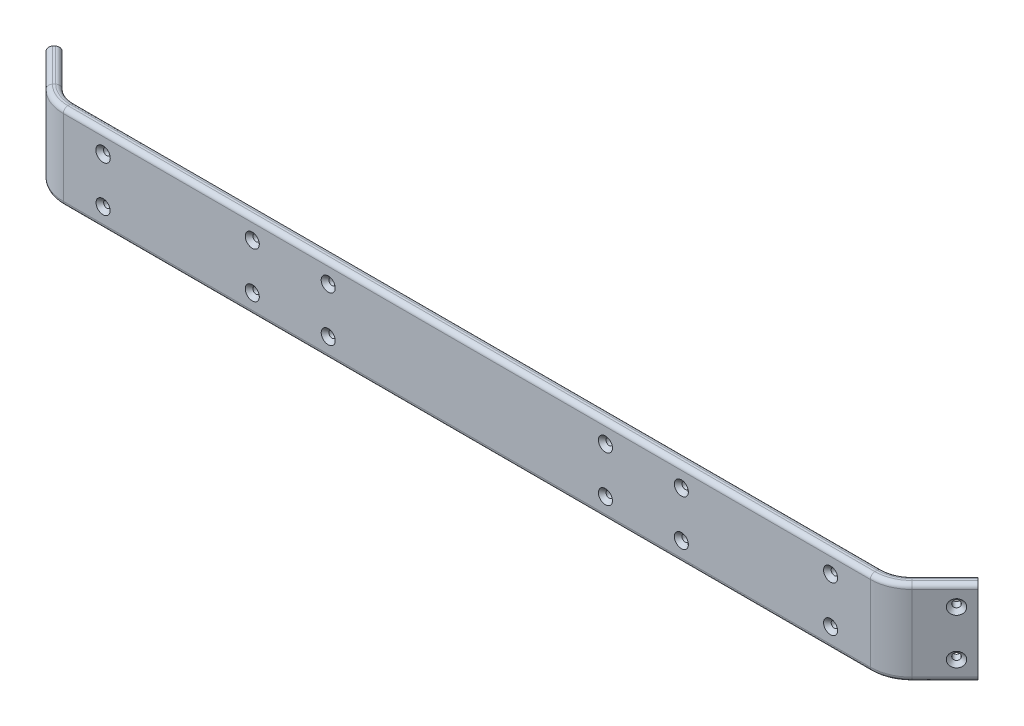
ISO-10303-21;
HEADER;
FILE_DESCRIPTION(('STEP AP214'),'2;1');
FILE_NAME('part.step','',(''),(''),'','','');
FILE_SCHEMA(('AUTOMOTIVE_DESIGN { 1 0 10303 214 1 1 1 1 }'));
ENDSEC;
DATA;
#1=APPLICATION_CONTEXT('core data for automotive mechanical design processes');
#2=APPLICATION_PROTOCOL_DEFINITION('international standard','automotive_design',2000,#1);
#3=PRODUCT_CONTEXT('',#1,'mechanical');
#4=PRODUCT('Part','Part','',(#3));
#5=PRODUCT_RELATED_PRODUCT_CATEGORY('part','',(#4));
#6=PRODUCT_DEFINITION_FORMATION('','',#4);
#7=PRODUCT_DEFINITION_CONTEXT('part definition',#1,'design');
#8=PRODUCT_DEFINITION('design','',#6,#7);
#9=PRODUCT_DEFINITION_SHAPE('','',#8);
#10=(LENGTH_UNIT() NAMED_UNIT(*) SI_UNIT(.MILLI.,.METRE.));
#11=(NAMED_UNIT(*) PLANE_ANGLE_UNIT() SI_UNIT($,.RADIAN.));
#12=(NAMED_UNIT(*) SI_UNIT($,.STERADIAN.) SOLID_ANGLE_UNIT());
#13=UNCERTAINTY_MEASURE_WITH_UNIT(LENGTH_MEASURE(1.E-05),#10,'distance_accuracy_value','');
#14=(GEOMETRIC_REPRESENTATION_CONTEXT(3) GLOBAL_UNCERTAINTY_ASSIGNED_CONTEXT((#13)) GLOBAL_UNIT_ASSIGNED_CONTEXT((#10,
#11,#12)) REPRESENTATION_CONTEXT('',''));
#15=CARTESIAN_POINT('',(0.,0.,0.));
#16=DIRECTION('',(0.,0.,1.));
#17=DIRECTION('',(1.,0.,0.));
#18=AXIS2_PLACEMENT_3D('',#15,#16,#17);
#19=CARTESIAN_POINT('',(355.383599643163,112.,-44.4878608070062));
#20=DIRECTION('',(0.707106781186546,0.,0.707106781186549));
#21=DIRECTION('',(0.707106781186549,0.,-0.707106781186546));
#22=AXIS2_PLACEMENT_3D('',#19,#20,#21);
#23=PLANE('',#22);
#24=DIRECTION('',(0.,-1.,0.));
#25=VECTOR('',#24,1.);
#26=CARTESIAN_POINT('',(365.990201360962,112.,-55.0944625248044));
#27=LINE('',#26,#25);
#28=CARTESIAN_POINT('',(365.990201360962,106.,-55.0944625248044));
#29=VERTEX_POINT('',#28);
#30=CARTESIAN_POINT('',(365.990201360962,5.99999999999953,-55.0944625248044));
#31=VERTEX_POINT('',#30);
#32=EDGE_CURVE('E482',#29,#31,#27,.T.);
#33=ORIENTED_EDGE('',*,*,#32,.T.);
#34=CARTESIAN_POINT('',(361.747560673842,5.99999999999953,-50.8518218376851));
#35=DIRECTION('',(0.707106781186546,0.,0.707106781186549));
#36=DIRECTION('',(0.707106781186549,0.,-0.707106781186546));
#37=AXIS2_PLACEMENT_3D('',#34,#35,#36);
#38=CIRCLE('',#37,6.);
#39=CARTESIAN_POINT('',(361.747560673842,-4.58909738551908E-13,-50.8518218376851));
#40=VERTEX_POINT('',#39);
#41=EDGE_CURVE('E261',#31,#40,#38,.F.);
#42=ORIENTED_EDGE('',*,*,#41,.T.);
#43=DIRECTION('',(0.707106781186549,0.,-0.707106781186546));
#44=VECTOR('',#43,1.);
#45=CARTESIAN_POINT('',(355.383599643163,-4.58909738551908E-13,-44.4878608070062));
#46=LINE('',#45,#44);
#47=CARTESIAN_POINT('',(359.626240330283,-4.58909738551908E-13,-48.7305014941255));
#48=VERTEX_POINT('',#47);
#49=EDGE_CURVE('E237',#48,#40,#46,.T.);
#50=ORIENTED_EDGE('',*,*,#49,.F.);
#51=CARTESIAN_POINT('',(359.626240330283,5.99999999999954,-48.7305014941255));
#52=DIRECTION('',(0.707106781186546,0.,0.707106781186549));
#53=DIRECTION('',(0.707106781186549,0.,-0.707106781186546));
#54=AXIS2_PLACEMENT_3D('',#51,#52,#53);
#55=CIRCLE('',#54,6.);
#56=CARTESIAN_POINT('',(355.383599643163,5.99999999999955,-44.4878608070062));
#57=VERTEX_POINT('',#56);
#58=EDGE_CURVE('E259',#48,#57,#55,.F.);
#59=ORIENTED_EDGE('',*,*,#58,.T.);
#60=DIRECTION('',(0.,-1.,0.));
#61=VECTOR('',#60,1.);
#62=CARTESIAN_POINT('',(355.383599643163,112.,-44.4878608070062));
#63=LINE('',#62,#61);
#64=CARTESIAN_POINT('',(355.383599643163,106.,-44.4878608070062));
#65=VERTEX_POINT('',#64);
#66=EDGE_CURVE('E473',#65,#57,#63,.T.);
#67=ORIENTED_EDGE('',*,*,#66,.F.);
#68=CARTESIAN_POINT('',(359.626240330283,106.,-48.7305014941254));
#69=DIRECTION('',(0.707106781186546,0.,0.707106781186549));
#70=DIRECTION('',(0.707106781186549,0.,-0.707106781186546));
#71=AXIS2_PLACEMENT_3D('',#68,#69,#70);
#72=CIRCLE('',#71,6.);
#73=CARTESIAN_POINT('',(359.626240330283,112.,-48.7305014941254));
#74=VERTEX_POINT('',#73);
#75=EDGE_CURVE('E255',#65,#74,#72,.F.);
#76=ORIENTED_EDGE('',*,*,#75,.T.);
#77=DIRECTION('',(0.707106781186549,0.,-0.707106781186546));
#78=VECTOR('',#77,1.);
#79=CARTESIAN_POINT('',(355.383599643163,112.,-44.4878608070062));
#80=LINE('',#79,#78);
#81=CARTESIAN_POINT('',(361.747560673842,112.,-50.8518218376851));
#82=VERTEX_POINT('',#81);
#83=EDGE_CURVE('E479',#74,#82,#80,.T.);
#84=ORIENTED_EDGE('',*,*,#83,.T.);
#85=CARTESIAN_POINT('',(361.747560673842,106.,-50.8518218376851));
#86=DIRECTION('',(0.707106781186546,0.,0.707106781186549));
#87=DIRECTION('',(0.707106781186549,0.,-0.707106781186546));
#88=AXIS2_PLACEMENT_3D('',#85,#86,#87);
#89=CIRCLE('',#88,6.);
#90=EDGE_CURVE('E257',#82,#29,#89,.F.);
#91=ORIENTED_EDGE('',*,*,#90,.T.);
#92=EDGE_LOOP('',(#33,#42,#50,#59,#67,#76,#84,#91));
#93=FACE_BOUND('',#92,.T.);
#94=ADVANCED_FACE('F30',(#93),#23,.F.);
#95=CARTESIAN_POINT('',(369.525735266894,25.9999999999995,-30.3457251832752));
#96=DIRECTION('',(0.707106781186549,0.,-0.707106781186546));
#97=DIRECTION('',(-0.707106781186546,0.,-0.707106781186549));
#98=AXIS2_PLACEMENT_3D('',#95,#96,#97);
#99=CYLINDRICAL_SURFACE('',#98,4.50000000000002);
#100=CARTESIAN_POINT('',(373.061269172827,25.9999999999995,-33.8812590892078));
#101=DIRECTION('',(-0.707106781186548,0.,0.707106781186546));
#102=DIRECTION('',(0.707106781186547,0.,0.707106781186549));
#103=AXIS2_PLACEMENT_3D('',#100,#101,#102);
#104=CIRCLE('',#103,4.50000000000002);
#105=CARTESIAN_POINT('',(376.243249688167,25.9999999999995,-30.6992785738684));
#106=VERTEX_POINT('',#105);
#107=EDGE_CURVE('E406',#106,#106,#104,.T.);
#108=ORIENTED_EDGE('',*,*,#107,.T.);
#109=EDGE_LOOP('',(#108));
#110=FACE_BOUND('',#109,.T.);
#111=CARTESIAN_POINT('',(380.132336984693,25.9999999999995,-40.9523269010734));
#112=DIRECTION('',(-0.707106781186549,0.,0.707106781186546));
#113=DIRECTION('',(0.707106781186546,0.,0.707106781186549));
#114=AXIS2_PLACEMENT_3D('',#111,#112,#113);
#115=CIRCLE('',#114,4.50000000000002);
#116=CARTESIAN_POINT('',(383.314317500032,25.9999999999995,-37.7703463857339));
#117=VERTEX_POINT('',#116);
#118=EDGE_CURVE('E467',#117,#117,#115,.T.);
#119=ORIENTED_EDGE('',*,*,#118,.F.);
#120=EDGE_LOOP('',(#119));
#121=FACE_BOUND('',#120,.T.);
#122=ADVANCED_FACE('F706',(#110,#121),#99,.F.);
#123=CARTESIAN_POINT('',(369.525735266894,85.9999999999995,-30.3457251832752));
#124=DIRECTION('',(0.707106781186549,0.,-0.707106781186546));
#125=DIRECTION('',(-0.707106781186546,0.,-0.707106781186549));
#126=AXIS2_PLACEMENT_3D('',#123,#124,#125);
#127=CYLINDRICAL_SURFACE('',#126,4.50000000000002);
#128=CARTESIAN_POINT('',(373.061269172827,85.9999999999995,-33.8812590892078));
#129=DIRECTION('',(-0.707106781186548,0.,0.707106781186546));
#130=DIRECTION('',(0.707106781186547,0.,0.707106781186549));
#131=AXIS2_PLACEMENT_3D('',#128,#129,#130);
#132=CIRCLE('',#131,4.50000000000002);
#133=CARTESIAN_POINT('',(376.243249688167,85.9999999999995,-30.6992785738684));
#134=VERTEX_POINT('',#133);
#135=EDGE_CURVE('E397',#134,#134,#132,.T.);
#136=ORIENTED_EDGE('',*,*,#135,.T.);
#137=EDGE_LOOP('',(#136));
#138=FACE_BOUND('',#137,.T.);
#139=CARTESIAN_POINT('',(380.132336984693,85.9999999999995,-40.9523269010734));
#140=DIRECTION('',(-0.707106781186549,0.,0.707106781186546));
#141=DIRECTION('',(0.707106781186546,0.,0.707106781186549));
#142=AXIS2_PLACEMENT_3D('',#139,#140,#141);
#143=CIRCLE('',#142,4.50000000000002);
#144=CARTESIAN_POINT('',(383.314317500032,85.9999999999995,-37.7703463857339));
#145=VERTEX_POINT('',#144);
#146=EDGE_CURVE('E464',#145,#145,#143,.T.);
#147=ORIENTED_EDGE('',*,*,#146,.F.);
#148=EDGE_LOOP('',(#147));
#149=FACE_BOUND('',#148,.T.);
#150=ADVANCED_FACE('F711',(#138,#149),#127,.F.);
#151=CARTESIAN_POINT('',(355.383599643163,112.,-44.4878608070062));
#152=DIRECTION('',(-0.707106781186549,0.,0.707106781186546));
#153=DIRECTION('',(0.707106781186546,0.,0.707106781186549));
#154=AXIS2_PLACEMENT_3D('',#151,#152,#153);
#155=PLANE('',#154);
#156=CARTESIAN_POINT('',(369.525735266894,85.9999999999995,-30.3457251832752));
#157=DIRECTION('',(-0.707106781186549,0.,0.707106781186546));
#158=DIRECTION('',(0.707106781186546,0.,0.707106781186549));
#159=AXIS2_PLACEMENT_3D('',#156,#157,#158);
#160=CIRCLE('',#159,9.50000000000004);
#161=CARTESIAN_POINT('',(376.243249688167,85.9999999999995,-23.6282107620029));
#162=VERTEX_POINT('',#161);
#163=EDGE_CURVE('E403',#162,#162,#160,.F.);
#164=ORIENTED_EDGE('',*,*,#163,.T.);
#165=EDGE_LOOP('',(#164));
#166=FACE_BOUND('',#165,.T.);
#167=CARTESIAN_POINT('',(369.525735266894,25.9999999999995,-30.3457251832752));
#168=DIRECTION('',(-0.707106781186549,0.,0.707106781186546));
#169=DIRECTION('',(0.707106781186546,0.,0.707106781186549));
#170=AXIS2_PLACEMENT_3D('',#167,#168,#169);
#171=CIRCLE('',#170,9.50000000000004);
#172=CARTESIAN_POINT('',(376.243249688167,25.9999999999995,-23.6282107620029));
#173=VERTEX_POINT('',#172);
#174=EDGE_CURVE('E400',#173,#173,#171,.F.);
#175=ORIENTED_EDGE('',*,*,#174,.T.);
#176=EDGE_LOOP('',(#175));
#177=FACE_BOUND('',#176,.T.);
#178=ORIENTED_EDGE('',*,*,#66,.T.);
#179=DIRECTION('',(-0.707106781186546,0.,-0.707106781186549));
#180=VECTOR('',#179,1.);
#181=CARTESIAN_POINT('',(355.383599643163,5.99999999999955,-44.4878608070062));
#182=LINE('',#181,#180);
#183=CARTESIAN_POINT('',(398.762333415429,5.99999999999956,-1.10912703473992));
#184=VERTEX_POINT('',#183);
#185=EDGE_CURVE('E274',#57,#184,#182,.F.);
#186=ORIENTED_EDGE('',*,*,#185,.T.);
#187=DIRECTION('',(0.,1.,0.));
#188=VECTOR('',#187,1.);
#189=CARTESIAN_POINT('',(398.762333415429,112.,-1.10912703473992));
#190=LINE('',#189,#188);
#191=CARTESIAN_POINT('',(398.762333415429,106.,-1.10912703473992));
#192=VERTEX_POINT('',#191);
#193=EDGE_CURVE('E476',#184,#192,#190,.T.);
#194=ORIENTED_EDGE('',*,*,#193,.T.);
#195=DIRECTION('',(0.707106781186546,0.,0.707106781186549));
#196=VECTOR('',#195,1.);
#197=CARTESIAN_POINT('',(355.383599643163,106.,-44.4878608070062));
#198=LINE('',#197,#196);
#199=EDGE_CURVE('E272',#192,#65,#198,.F.);
#200=ORIENTED_EDGE('',*,*,#199,.T.);
#201=EDGE_LOOP('',(#178,#186,#194,#200));
#202=FACE_BOUND('',#201,.T.);
#203=ADVANCED_FACE('F720',(#166,#177,#202),#155,.T.);
#204=CARTESIAN_POINT('',(355.383599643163,112.,-44.4878608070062));
#205=DIRECTION('',(0.,1.,0.));
#206=DIRECTION('',(-0.707106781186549,0.,0.707106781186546));
#207=AXIS2_PLACEMENT_3D('',#204,#205,#206);
#208=PLANE('',#207);
#209=DIRECTION('',(0.707106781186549,0.,-0.707106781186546));
#210=VECTOR('',#209,1.);
#211=CARTESIAN_POINT('',(398.762333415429,112.,-1.10912703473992));
#212=LINE('',#211,#210);
#213=CARTESIAN_POINT('',(403.004974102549,112.,-5.35176772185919));
#214=VERTEX_POINT('',#213);
#215=CARTESIAN_POINT('',(405.126294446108,112.,-7.47308806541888));
#216=VERTEX_POINT('',#215);
#217=EDGE_CURVE('E470',#214,#216,#212,.T.);
#218=ORIENTED_EDGE('',*,*,#217,.T.);
#219=DIRECTION('',(0.707106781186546,0.,0.707106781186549));
#220=VECTOR('',#219,1.);
#221=CARTESIAN_POINT('',(361.747560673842,112.,-50.8518218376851));
#222=LINE('',#221,#220);
#223=EDGE_CURVE('E320',#216,#82,#222,.F.);
#224=ORIENTED_EDGE('',*,*,#223,.T.);
#225=ORIENTED_EDGE('',*,*,#83,.F.);
#226=DIRECTION('',(0.707106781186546,0.,0.707106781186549));
#227=VECTOR('',#226,1.);
#228=CARTESIAN_POINT('',(359.626240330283,112.,-48.7305014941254));
#229=LINE('',#228,#227);
#230=EDGE_CURVE('E318',#74,#214,#229,.T.);
#231=ORIENTED_EDGE('',*,*,#230,.T.);
#232=EDGE_LOOP('',(#218,#224,#225,#231));
#233=FACE_BOUND('',#232,.T.);
#234=ADVANCED_FACE('F670',(#233),#208,.T.);
#235=CARTESIAN_POINT('',(365.990201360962,112.,-55.0944625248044));
#236=DIRECTION('',(-0.707106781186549,0.,0.707106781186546));
#237=DIRECTION('',(0.707106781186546,0.,0.707106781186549));
#238=AXIS2_PLACEMENT_3D('',#235,#236,#237);
#239=PLANE('',#238);
#240=DIRECTION('',(0.,1.,0.));
#241=VECTOR('',#240,1.);
#242=CARTESIAN_POINT('',(409.368935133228,112.,-11.7157287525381));
#243=LINE('',#242,#241);
#244=CARTESIAN_POINT('',(409.368935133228,5.99999999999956,-11.7157287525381));
#245=VERTEX_POINT('',#244);
#246=CARTESIAN_POINT('',(409.368935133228,106.,-11.7157287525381));
#247=VERTEX_POINT('',#246);
#248=EDGE_CURVE('E484',#245,#247,#243,.T.);
#249=ORIENTED_EDGE('',*,*,#248,.F.);
#250=DIRECTION('',(-0.707106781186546,0.,-0.707106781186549));
#251=VECTOR('',#250,1.);
#252=CARTESIAN_POINT('',(365.990201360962,5.99999999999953,-55.0944625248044));
#253=LINE('',#252,#251);
#254=EDGE_CURVE('E252',#245,#31,#253,.T.);
#255=ORIENTED_EDGE('',*,*,#254,.T.);
#256=ORIENTED_EDGE('',*,*,#32,.F.);
#257=DIRECTION('',(0.707106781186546,0.,0.707106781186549));
#258=VECTOR('',#257,1.);
#259=CARTESIAN_POINT('',(409.368935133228,106.,-11.7157287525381));
#260=LINE('',#259,#258);
#261=EDGE_CURVE('E250',#29,#247,#260,.T.);
#262=ORIENTED_EDGE('',*,*,#261,.T.);
#263=EDGE_LOOP('',(#249,#255,#256,#262));
#264=FACE_BOUND('',#263,.T.);
#265=ORIENTED_EDGE('',*,*,#118,.T.);
#266=EDGE_LOOP('',(#265));
#267=FACE_BOUND('',#266,.T.);
#268=ORIENTED_EDGE('',*,*,#146,.T.);
#269=EDGE_LOOP('',(#268));
#270=FACE_BOUND('',#269,.T.);
#271=ADVANCED_FACE('F726',(#264,#267,#270),#239,.F.);
#272=CARTESIAN_POINT('',(1246.33814393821,-3.04609337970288E-13,846.466683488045));
#273=DIRECTION('',(0.,-1.,0.));
#274=DIRECTION('',(0.707106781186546,0.,0.707106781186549));
#275=AXIS2_PLACEMENT_3D('',#272,#273,#274);
#276=PLANE('',#275);
#277=ORIENTED_EDGE('',*,*,#49,.T.);
#278=DIRECTION('',(-0.707106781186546,0.,-0.707106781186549));
#279=VECTOR('',#278,1.);
#280=CARTESIAN_POINT('',(405.126294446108,-4.51397171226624E-13,-7.47308806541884));
#281=LINE('',#280,#279);
#282=CARTESIAN_POINT('',(405.126294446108,-4.51397171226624E-13,-7.47308806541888));
#283=VERTEX_POINT('',#282);
#284=EDGE_CURVE('E266',#40,#283,#281,.F.);
#285=ORIENTED_EDGE('',*,*,#284,.T.);
#286=DIRECTION('',(-0.707106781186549,0.,0.707106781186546));
#287=VECTOR('',#286,1.);
#288=CARTESIAN_POINT('',(398.762333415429,-4.51397171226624E-13,-1.10912703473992));
#289=LINE('',#288,#287);
#290=CARTESIAN_POINT('',(403.004974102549,-4.51397171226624E-13,-5.35176772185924));
#291=VERTEX_POINT('',#290);
#292=EDGE_CURVE('E461',#283,#291,#289,.T.);
#293=ORIENTED_EDGE('',*,*,#292,.T.);
#294=DIRECTION('',(-0.707106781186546,0.,-0.707106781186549));
#295=VECTOR('',#294,1.);
#296=CARTESIAN_POINT('',(1250.58078462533,-3.04609337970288E-13,842.224042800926));
#297=LINE('',#296,#295);
#298=EDGE_CURVE('E263',#291,#48,#297,.T.);
#299=ORIENTED_EDGE('',*,*,#298,.T.);
#300=EDGE_LOOP('',(#277,#285,#293,#299));
#301=FACE_BOUND('',#300,.T.);
#302=ADVANCED_FACE('F32',(#301),#276,.T.);
#303=CARTESIAN_POINT('',(1582.61640035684,-3.04609337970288E-13,-44.4878608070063));
#304=DIRECTION('',(-0.707106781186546,0.,0.707106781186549));
#305=DIRECTION('',(0.707106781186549,0.,0.707106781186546));
#306=AXIS2_PLACEMENT_3D('',#303,#304,#305);
#307=PLANE('',#306);
#308=DIRECTION('',(0.,1.,0.));
#309=VECTOR('',#308,1.);
#310=CARTESIAN_POINT('',(1572.00979863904,-3.04609337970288E-13,-55.0944625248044));
#311=LINE('',#310,#309);
#312=CARTESIAN_POINT('',(1572.00979863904,5.99999999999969,-55.0944625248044));
#313=VERTEX_POINT('',#312);
#314=CARTESIAN_POINT('',(1572.00979863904,106.,-55.0944625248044));
#315=VERTEX_POINT('',#314);
#316=EDGE_CURVE('E218',#313,#315,#311,.T.);
#317=ORIENTED_EDGE('',*,*,#316,.T.);
#318=CARTESIAN_POINT('',(1576.25243932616,106.,-50.8518218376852));
#319=DIRECTION('',(-0.707106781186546,0.,0.707106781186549));
#320=DIRECTION('',(0.707106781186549,0.,0.707106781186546));
#321=AXIS2_PLACEMENT_3D('',#318,#319,#320);
#322=CIRCLE('',#321,6.);
#323=CARTESIAN_POINT('',(1576.25243932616,112.,-50.8518218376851));
#324=VERTEX_POINT('',#323);
#325=EDGE_CURVE('E232',#315,#324,#322,.F.);
#326=ORIENTED_EDGE('',*,*,#325,.T.);
#327=DIRECTION('',(-0.707106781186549,0.,-0.707106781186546));
#328=VECTOR('',#327,1.);
#329=CARTESIAN_POINT('',(1582.61640035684,112.,-44.4878608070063));
#330=LINE('',#329,#328);
#331=CARTESIAN_POINT('',(1578.37375966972,112.,-48.7305014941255));
#332=VERTEX_POINT('',#331);
#333=EDGE_CURVE('E441',#332,#324,#330,.T.);
#334=ORIENTED_EDGE('',*,*,#333,.F.);
#335=CARTESIAN_POINT('',(1578.37375966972,106.,-48.7305014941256));
#336=DIRECTION('',(-0.707106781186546,0.,0.707106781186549));
#337=DIRECTION('',(0.707106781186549,0.,0.707106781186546));
#338=AXIS2_PLACEMENT_3D('',#335,#336,#337);
#339=CIRCLE('',#338,6.);
#340=CARTESIAN_POINT('',(1582.61640035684,106.,-44.4878608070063));
#341=VERTEX_POINT('',#340);
#342=EDGE_CURVE('E242',#332,#341,#339,.F.);
#343=ORIENTED_EDGE('',*,*,#342,.T.);
#344=DIRECTION('',(0.,1.,0.));
#345=VECTOR('',#344,1.);
#346=CARTESIAN_POINT('',(1582.61640035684,-3.04609337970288E-13,-44.4878608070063));
#347=LINE('',#346,#345);
#348=CARTESIAN_POINT('',(1582.61640035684,5.9999999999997,-44.4878608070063));
#349=VERTEX_POINT('',#348);
#350=EDGE_CURVE('E449',#349,#341,#347,.T.);
#351=ORIENTED_EDGE('',*,*,#350,.F.);
#352=CARTESIAN_POINT('',(1578.37375966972,5.9999999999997,-48.7305014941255));
#353=DIRECTION('',(-0.707106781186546,0.,0.707106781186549));
#354=DIRECTION('',(0.707106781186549,0.,0.707106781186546));
#355=AXIS2_PLACEMENT_3D('',#352,#353,#354);
#356=CIRCLE('',#355,6.);
#357=CARTESIAN_POINT('',(1578.37375966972,-3.04609337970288E-13,-48.7305014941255));
#358=VERTEX_POINT('',#357);
#359=EDGE_CURVE('E233',#349,#358,#356,.F.);
#360=ORIENTED_EDGE('',*,*,#359,.T.);
#361=DIRECTION('',(-0.707106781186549,0.,-0.707106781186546));
#362=VECTOR('',#361,1.);
#363=CARTESIAN_POINT('',(1582.61640035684,-3.04609337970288E-13,-44.4878608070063));
#364=LINE('',#363,#362);
#365=CARTESIAN_POINT('',(1576.25243932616,-3.04609337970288E-13,-50.8518218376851));
#366=VERTEX_POINT('',#365);
#367=EDGE_CURVE('E455',#358,#366,#364,.T.);
#368=ORIENTED_EDGE('',*,*,#367,.T.);
#369=CARTESIAN_POINT('',(1576.25243932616,5.99999999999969,-50.8518218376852));
#370=DIRECTION('',(-0.707106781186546,0.,0.707106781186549));
#371=DIRECTION('',(0.707106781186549,0.,0.707106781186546));
#372=AXIS2_PLACEMENT_3D('',#369,#370,#371);
#373=CIRCLE('',#372,6.);
#374=EDGE_CURVE('E235',#366,#313,#373,.F.);
#375=ORIENTED_EDGE('',*,*,#374,.T.);
#376=EDGE_LOOP('',(#317,#326,#334,#343,#351,#360,#368,#375));
#377=FACE_BOUND('',#376,.T.);
#378=ADVANCED_FACE('F631',(#377),#307,.F.);
#379=CARTESIAN_POINT('',(1568.47426473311,26.,-30.3457251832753));
#380=DIRECTION('',(-0.707106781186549,0.,-0.707106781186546));
#381=DIRECTION('',(-0.707106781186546,0.,0.707106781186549));
#382=AXIS2_PLACEMENT_3D('',#379,#380,#381);
#383=CYLINDRICAL_SURFACE('',#382,4.50000000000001);
#384=CARTESIAN_POINT('',(1564.93873082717,26.,-33.8812590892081));
#385=DIRECTION('',(0.707106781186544,0.,0.707106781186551));
#386=DIRECTION('',(0.707106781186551,0.,-0.707106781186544));
#387=AXIS2_PLACEMENT_3D('',#384,#385,#386);
#388=CIRCLE('',#387,4.50000000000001);
#389=CARTESIAN_POINT('',(1568.12071134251,26.,-37.0632396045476));
#390=VERTEX_POINT('',#389);
#391=EDGE_CURVE('E11',#390,#390,#388,.T.);
#392=ORIENTED_EDGE('',*,*,#391,.T.);
#393=EDGE_LOOP('',(#392));
#394=FACE_BOUND('',#393,.T.);
#395=CARTESIAN_POINT('',(1557.86766301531,26.,-40.9523269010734));
#396=DIRECTION('',(0.707106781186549,0.,0.707106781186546));
#397=DIRECTION('',(0.707106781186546,0.,-0.707106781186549));
#398=AXIS2_PLACEMENT_3D('',#395,#396,#397);
#399=CIRCLE('',#398,4.50000000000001);
#400=CARTESIAN_POINT('',(1561.04964353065,26.,-44.1343074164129));
#401=VERTEX_POINT('',#400);
#402=EDGE_CURVE('E438',#401,#401,#399,.T.);
#403=ORIENTED_EDGE('',*,*,#402,.F.);
#404=EDGE_LOOP('',(#403));
#405=FACE_BOUND('',#404,.T.);
#406=ADVANCED_FACE('F431',(#394,#405),#383,.F.);
#407=CARTESIAN_POINT('',(1568.47426473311,86.,-30.3457251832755));
#408=DIRECTION('',(-0.707106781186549,0.,-0.707106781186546));
#409=DIRECTION('',(-0.707106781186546,0.,0.707106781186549));
#410=AXIS2_PLACEMENT_3D('',#407,#408,#409);
#411=CYLINDRICAL_SURFACE('',#410,4.50000000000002);
#412=CARTESIAN_POINT('',(1564.93873082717,86.,-33.8812590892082));
#413=DIRECTION('',(0.707106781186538,0.,0.707106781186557));
#414=DIRECTION('',(0.707106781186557,0.,-0.707106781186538));
#415=AXIS2_PLACEMENT_3D('',#412,#413,#414);
#416=CIRCLE('',#415,4.50000000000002);
#417=CARTESIAN_POINT('',(1568.12071134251,86.,-37.0632396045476));
#418=VERTEX_POINT('',#417);
#419=EDGE_CURVE('E409',#418,#418,#416,.T.);
#420=ORIENTED_EDGE('',*,*,#419,.T.);
#421=EDGE_LOOP('',(#420));
#422=FACE_BOUND('',#421,.T.);
#423=CARTESIAN_POINT('',(1557.86766301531,86.,-40.9523269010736));
#424=DIRECTION('',(0.707106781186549,0.,0.707106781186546));
#425=DIRECTION('',(0.707106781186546,0.,-0.707106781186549));
#426=AXIS2_PLACEMENT_3D('',#423,#424,#425);
#427=CIRCLE('',#426,4.50000000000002);
#428=CARTESIAN_POINT('',(1561.04964353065,86.,-44.1343074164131));
#429=VERTEX_POINT('',#428);
#430=EDGE_CURVE('E435',#429,#429,#427,.T.);
#431=ORIENTED_EDGE('',*,*,#430,.F.);
#432=EDGE_LOOP('',(#431));
#433=FACE_BOUND('',#432,.T.);
#434=ADVANCED_FACE('F428',(#422,#433),#411,.F.);
#435=CARTESIAN_POINT('',(691.661856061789,112.,846.466683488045));
#436=DIRECTION('',(0.707106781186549,0.,0.707106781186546));
#437=DIRECTION('',(0.707106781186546,0.,-0.707106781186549));
#438=AXIS2_PLACEMENT_3D('',#435,#436,#437);
#439=PLANE('',#438);
#440=CARTESIAN_POINT('',(1568.47426473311,86.,-30.3457251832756));
#441=DIRECTION('',(0.707106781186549,0.,0.707106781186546));
#442=DIRECTION('',(0.707106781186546,0.,-0.707106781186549));
#443=AXIS2_PLACEMENT_3D('',#440,#441,#442);
#444=CIRCLE('',#443,9.4999999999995);
#445=CARTESIAN_POINT('',(1575.19177915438,86.,-37.0632396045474));
#446=VERTEX_POINT('',#445);
#447=EDGE_CURVE('E38',#446,#446,#444,.F.);
#448=ORIENTED_EDGE('',*,*,#447,.T.);
#449=EDGE_LOOP('',(#448));
#450=FACE_BOUND('',#449,.T.);
#451=CARTESIAN_POINT('',(1568.47426473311,26.,-30.3457251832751));
#452=DIRECTION('',(0.707106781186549,0.,0.707106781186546));
#453=DIRECTION('',(0.707106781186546,0.,-0.707106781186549));
#454=AXIS2_PLACEMENT_3D('',#451,#452,#453);
#455=CIRCLE('',#454,9.49999999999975);
#456=CARTESIAN_POINT('',(1575.19177915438,26.,-37.0632396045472));
#457=VERTEX_POINT('',#456);
#458=EDGE_CURVE('E412',#457,#457,#455,.F.);
#459=ORIENTED_EDGE('',*,*,#458,.T.);
#460=EDGE_LOOP('',(#459));
#461=FACE_BOUND('',#460,.T.);
#462=ORIENTED_EDGE('',*,*,#350,.T.);
#463=DIRECTION('',(0.707106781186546,0.,-0.707106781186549));
#464=VECTOR('',#463,1.);
#465=CARTESIAN_POINT('',(691.661856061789,106.,846.466683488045));
#466=LINE('',#465,#464);
#467=CARTESIAN_POINT('',(1539.23766658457,106.,-1.10912703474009));
#468=VERTEX_POINT('',#467);
#469=EDGE_CURVE('E270',#341,#468,#466,.F.);
#470=ORIENTED_EDGE('',*,*,#469,.T.);
#471=DIRECTION('',(0.,-1.,0.));
#472=VECTOR('',#471,1.);
#473=CARTESIAN_POINT('',(1539.23766658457,112.,-1.10912703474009));
#474=LINE('',#473,#472);
#475=CARTESIAN_POINT('',(1539.23766658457,5.99999999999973,-1.10912703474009));
#476=VERTEX_POINT('',#475);
#477=EDGE_CURVE('E452',#468,#476,#474,.T.);
#478=ORIENTED_EDGE('',*,*,#477,.T.);
#479=DIRECTION('',(-0.707106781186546,0.,0.707106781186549));
#480=VECTOR('',#479,1.);
#481=CARTESIAN_POINT('',(691.661856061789,5.99999999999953,846.466683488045));
#482=LINE('',#481,#480);
#483=EDGE_CURVE('E268',#476,#349,#482,.F.);
#484=ORIENTED_EDGE('',*,*,#483,.T.);
#485=EDGE_LOOP('',(#462,#470,#478,#484));
#486=FACE_BOUND('',#485,.T.);
#487=ADVANCED_FACE('F417',(#450,#461,#486),#439,.T.);
#488=CARTESIAN_POINT('',(1582.61640035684,-3.04609337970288E-13,-44.4878608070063));
#489=DIRECTION('',(0.,-1.,0.));
#490=DIRECTION('',(0.707106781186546,0.,-0.707106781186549));
#491=AXIS2_PLACEMENT_3D('',#488,#489,#490);
#492=PLANE('',#491);
#493=DIRECTION('',(-0.707106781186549,0.,-0.707106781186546));
#494=VECTOR('',#493,1.);
#495=CARTESIAN_POINT('',(1539.23766658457,-3.12121905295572E-13,-1.10912703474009));
#496=LINE('',#495,#494);
#497=CARTESIAN_POINT('',(1534.99502589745,-3.12121905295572E-13,-5.35176772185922));
#498=VERTEX_POINT('',#497);
#499=CARTESIAN_POINT('',(1532.87370555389,-3.12121905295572E-13,-7.4730880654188));
#500=VERTEX_POINT('',#499);
#501=EDGE_CURVE('E444',#498,#500,#496,.T.);
#502=ORIENTED_EDGE('',*,*,#501,.T.);
#503=DIRECTION('',(-0.707106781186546,0.,0.707106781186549));
#504=VECTOR('',#503,1.);
#505=CARTESIAN_POINT('',(1576.25243932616,-3.04609337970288E-13,-50.8518218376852));
#506=LINE('',#505,#504);
#507=EDGE_CURVE('E323',#500,#366,#506,.F.);
#508=ORIENTED_EDGE('',*,*,#507,.T.);
#509=ORIENTED_EDGE('',*,*,#367,.F.);
#510=DIRECTION('',(-0.707106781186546,0.,0.707106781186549));
#511=VECTOR('',#510,1.);
#512=CARTESIAN_POINT('',(1578.37375966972,-3.04609337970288E-13,-48.7305014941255));
#513=LINE('',#512,#511);
#514=EDGE_CURVE('E52',#358,#498,#513,.T.);
#515=ORIENTED_EDGE('',*,*,#514,.T.);
#516=EDGE_LOOP('',(#502,#508,#509,#515));
#517=FACE_BOUND('',#516,.T.);
#518=ADVANCED_FACE('F633',(#517),#492,.T.);
#519=CARTESIAN_POINT('',(681.055254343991,112.,835.860081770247));
#520=DIRECTION('',(0.707106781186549,0.,0.707106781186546));
#521=DIRECTION('',(0.707106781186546,0.,-0.707106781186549));
#522=AXIS2_PLACEMENT_3D('',#519,#520,#521);
#523=PLANE('',#522);
#524=DIRECTION('',(0.,-1.,0.));
#525=VECTOR('',#524,1.);
#526=CARTESIAN_POINT('',(1528.63106486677,112.,-11.7157287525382));
#527=LINE('',#526,#525);
#528=CARTESIAN_POINT('',(1528.63106486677,106.,-11.7157287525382));
#529=VERTEX_POINT('',#528);
#530=CARTESIAN_POINT('',(1528.63106486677,5.99999999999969,-11.7157287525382));
#531=VERTEX_POINT('',#530);
#532=EDGE_CURVE('E197',#529,#531,#527,.T.);
#533=ORIENTED_EDGE('',*,*,#532,.F.);
#534=DIRECTION('',(0.707106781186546,0.,-0.707106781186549));
#535=VECTOR('',#534,1.);
#536=CARTESIAN_POINT('',(1572.00979863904,106.,-55.0944625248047));
#537=LINE('',#536,#535);
#538=EDGE_CURVE('E214',#529,#315,#537,.T.);
#539=ORIENTED_EDGE('',*,*,#538,.T.);
#540=ORIENTED_EDGE('',*,*,#316,.F.);
#541=DIRECTION('',(-0.707106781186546,0.,0.707106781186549));
#542=VECTOR('',#541,1.);
#543=CARTESIAN_POINT('',(1528.63106486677,5.99999999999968,-11.7157287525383));
#544=LINE('',#543,#542);
#545=EDGE_CURVE('E217',#313,#531,#544,.T.);
#546=ORIENTED_EDGE('',*,*,#545,.T.);
#547=EDGE_LOOP('',(#533,#539,#540,#546));
#548=FACE_BOUND('',#547,.T.);
#549=ORIENTED_EDGE('',*,*,#402,.T.);
#550=EDGE_LOOP('',(#549));
#551=FACE_BOUND('',#550,.T.);
#552=ORIENTED_EDGE('',*,*,#430,.T.);
#553=EDGE_LOOP('',(#552));
#554=FACE_BOUND('',#553,.T.);
#555=ADVANCED_FACE('F210',(#548,#551,#554),#523,.F.);
#556=CARTESIAN_POINT('',(691.661856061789,112.,846.466683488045));
#557=DIRECTION('',(0.,1.,0.));
#558=DIRECTION('',(0.707106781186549,0.,0.707106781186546));
#559=AXIS2_PLACEMENT_3D('',#556,#557,#558);
#560=PLANE('',#559);
#561=ORIENTED_EDGE('',*,*,#333,.T.);
#562=DIRECTION('',(0.707106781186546,0.,-0.707106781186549));
#563=VECTOR('',#562,1.);
#564=CARTESIAN_POINT('',(1532.87370555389,112.,-7.47308806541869));
#565=LINE('',#564,#563);
#566=CARTESIAN_POINT('',(1532.87370555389,112.,-7.47308806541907));
#567=VERTEX_POINT('',#566);
#568=EDGE_CURVE('E248',#324,#567,#565,.F.);
#569=ORIENTED_EDGE('',*,*,#568,.T.);
#570=DIRECTION('',(0.707106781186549,0.,0.707106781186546));
#571=VECTOR('',#570,1.);
#572=CARTESIAN_POINT('',(1539.23766658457,112.,-1.10912703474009));
#573=LINE('',#572,#571);
#574=CARTESIAN_POINT('',(1534.99502589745,112.,-5.35176772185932));
#575=VERTEX_POINT('',#574);
#576=EDGE_CURVE('E437',#567,#575,#573,.T.);
#577=ORIENTED_EDGE('',*,*,#576,.T.);
#578=DIRECTION('',(0.707106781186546,0.,-0.707106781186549));
#579=VECTOR('',#578,1.);
#580=CARTESIAN_POINT('',(687.419215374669,112.,842.224042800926));
#581=LINE('',#580,#579);
#582=EDGE_CURVE('E245',#575,#332,#581,.T.);
#583=ORIENTED_EDGE('',*,*,#582,.T.);
#584=EDGE_LOOP('',(#561,#569,#577,#583));
#585=FACE_BOUND('',#584,.T.);
#586=ADVANCED_FACE('F691',(#585),#560,.T.);
#587=CARTESIAN_POINT('',(339.,112.,0.));
#588=DIRECTION('',(0.,0.,1.));
#589=DIRECTION('',(1.,0.,0.));
#590=AXIS2_PLACEMENT_3D('',#587,#588,#589);
#591=PLANE('',#590);
#592=CARTESIAN_POINT('',(1448.,86.,0.));
#593=DIRECTION('',(0.,0.,1.));
#594=DIRECTION('',(1.,0.,0.));
#595=AXIS2_PLACEMENT_3D('',#592,#593,#594);
#596=CIRCLE('',#595,4.25000000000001);
#597=CARTESIAN_POINT('',(1452.25,86.,0.));
#598=VERTEX_POINT('',#597);
#599=EDGE_CURVE('E543',#598,#598,#596,.T.);
#600=ORIENTED_EDGE('',*,*,#599,.T.);
#601=EDGE_LOOP('',(#600));
#602=FACE_BOUND('',#601,.T.);
#603=CARTESIAN_POINT('',(686.5,86.,0.));
#604=DIRECTION('',(0.,0.,1.));
#605=DIRECTION('',(1.,0.,0.));
#606=AXIS2_PLACEMENT_3D('',#603,#604,#605);
#607=CIRCLE('',#606,4.25);
#608=CARTESIAN_POINT('',(690.75,86.,0.));
#609=VERTEX_POINT('',#608);
#610=EDGE_CURVE('E537',#609,#609,#607,.T.);
#611=ORIENTED_EDGE('',*,*,#610,.T.);
#612=EDGE_LOOP('',(#611));
#613=FACE_BOUND('',#612,.T.);
#614=CARTESIAN_POINT('',(786.5,26.,0.));
#615=DIRECTION('',(0.,0.,1.));
#616=DIRECTION('',(1.,0.,0.));
#617=AXIS2_PLACEMENT_3D('',#614,#615,#616);
#618=CIRCLE('',#617,4.25);
#619=CARTESIAN_POINT('',(790.75,26.,0.));
#620=VERTEX_POINT('',#619);
#621=EDGE_CURVE('E531',#620,#620,#618,.T.);
#622=ORIENTED_EDGE('',*,*,#621,.T.);
#623=EDGE_LOOP('',(#622));
#624=FACE_BOUND('',#623,.T.);
#625=CARTESIAN_POINT('',(1251.5,26.,0.));
#626=DIRECTION('',(0.,0.,1.));
#627=DIRECTION('',(1.,0.,0.));
#628=AXIS2_PLACEMENT_3D('',#625,#626,#627);
#629=CIRCLE('',#628,4.24999999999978);
#630=CARTESIAN_POINT('',(1255.75,26.,0.));
#631=VERTEX_POINT('',#630);
#632=EDGE_CURVE('E525',#631,#631,#629,.T.);
#633=ORIENTED_EDGE('',*,*,#632,.T.);
#634=EDGE_LOOP('',(#633));
#635=FACE_BOUND('',#634,.T.);
#636=CARTESIAN_POINT('',(1151.5,26.,0.));
#637=DIRECTION('',(0.,0.,1.));
#638=DIRECTION('',(1.,0.,0.));
#639=AXIS2_PLACEMENT_3D('',#636,#637,#638);
#640=CIRCLE('',#639,4.24999999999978);
#641=CARTESIAN_POINT('',(1155.75,26.,0.));
#642=VERTEX_POINT('',#641);
#643=EDGE_CURVE('E519',#642,#642,#640,.T.);
#644=ORIENTED_EDGE('',*,*,#643,.T.);
#645=EDGE_LOOP('',(#644));
#646=FACE_BOUND('',#645,.T.);
#647=CARTESIAN_POINT('',(490.,86.,0.));
#648=DIRECTION('',(0.,0.,1.));
#649=DIRECTION('',(1.,0.,0.));
#650=AXIS2_PLACEMENT_3D('',#647,#648,#649);
#651=CIRCLE('',#650,4.50000000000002);
#652=CARTESIAN_POINT('',(494.5,86.,0.));
#653=VERTEX_POINT('',#652);
#654=EDGE_CURVE('E513',#653,#653,#651,.T.);
#655=ORIENTED_EDGE('',*,*,#654,.T.);
#656=EDGE_LOOP('',(#655));
#657=FACE_BOUND('',#656,.T.);
#658=CARTESIAN_POINT('',(1151.5,86.,0.));
#659=DIRECTION('',(0.,0.,1.));
#660=DIRECTION('',(1.,0.,0.));
#661=AXIS2_PLACEMENT_3D('',#658,#659,#660);
#662=CIRCLE('',#661,4.24999999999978);
#663=CARTESIAN_POINT('',(1155.75,86.,0.));
#664=VERTEX_POINT('',#663);
#665=EDGE_CURVE('E516',#664,#664,#662,.T.);
#666=ORIENTED_EDGE('',*,*,#665,.T.);
#667=EDGE_LOOP('',(#666));
#668=FACE_BOUND('',#667,.T.);
#669=CARTESIAN_POINT('',(1251.5,86.,0.));
#670=DIRECTION('',(0.,0.,1.));
#671=DIRECTION('',(1.,0.,0.));
#672=AXIS2_PLACEMENT_3D('',#669,#670,#671);
#673=CIRCLE('',#672,4.24999999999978);
#674=CARTESIAN_POINT('',(1255.75,86.,0.));
#675=VERTEX_POINT('',#674);
#676=EDGE_CURVE('E522',#675,#675,#673,.T.);
#677=ORIENTED_EDGE('',*,*,#676,.T.);
#678=EDGE_LOOP('',(#677));
#679=FACE_BOUND('',#678,.T.);
#680=CARTESIAN_POINT('',(786.5,86.,0.));
#681=DIRECTION('',(0.,0.,1.));
#682=DIRECTION('',(1.,0.,0.));
#683=AXIS2_PLACEMENT_3D('',#680,#681,#682);
#684=CIRCLE('',#683,4.25);
#685=CARTESIAN_POINT('',(790.75,86.,0.));
#686=VERTEX_POINT('',#685);
#687=EDGE_CURVE('E528',#686,#686,#684,.T.);
#688=ORIENTED_EDGE('',*,*,#687,.T.);
#689=EDGE_LOOP('',(#688));
#690=FACE_BOUND('',#689,.T.);
#691=CARTESIAN_POINT('',(490.,25.9999999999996,0.));
#692=DIRECTION('',(0.,0.,1.));
#693=DIRECTION('',(1.,0.,0.));
#694=AXIS2_PLACEMENT_3D('',#691,#692,#693);
#695=CIRCLE('',#694,4.24999999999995);
#696=CARTESIAN_POINT('',(494.25,25.9999999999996,0.));
#697=VERTEX_POINT('',#696);
#698=EDGE_CURVE('E534',#697,#697,#695,.T.);
#699=ORIENTED_EDGE('',*,*,#698,.T.);
#700=EDGE_LOOP('',(#699));
#701=FACE_BOUND('',#700,.T.);
#702=CARTESIAN_POINT('',(686.5,25.9999999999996,0.));
#703=DIRECTION('',(0.,0.,1.));
#704=DIRECTION('',(1.,0.,0.));
#705=AXIS2_PLACEMENT_3D('',#702,#703,#704);
#706=CIRCLE('',#705,4.25);
#707=CARTESIAN_POINT('',(690.75,25.9999999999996,0.));
#708=VERTEX_POINT('',#707);
#709=EDGE_CURVE('E540',#708,#708,#706,.T.);
#710=ORIENTED_EDGE('',*,*,#709,.T.);
#711=EDGE_LOOP('',(#710));
#712=FACE_BOUND('',#711,.T.);
#713=CARTESIAN_POINT('',(1448.,25.9999999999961,0.));
#714=DIRECTION('',(0.,0.,1.));
#715=DIRECTION('',(1.,0.,0.));
#716=AXIS2_PLACEMENT_3D('',#713,#714,#715);
#717=CIRCLE('',#716,4.25000000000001);
#718=CARTESIAN_POINT('',(1452.25,25.9999999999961,0.));
#719=VERTEX_POINT('',#718);
#720=EDGE_CURVE('E546',#719,#719,#717,.T.);
#721=ORIENTED_EDGE('',*,*,#720,.T.);
#722=EDGE_LOOP('',(#721));
#723=FACE_BOUND('',#722,.T.);
#724=DIRECTION('',(0.,1.,0.));
#725=VECTOR('',#724,1.);
#726=CARTESIAN_POINT('',(437.65320638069,112.,0.));
#727=LINE('',#726,#725);
#728=CARTESIAN_POINT('',(437.65320638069,5.99999999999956,0.));
#729=VERTEX_POINT('',#728);
#730=CARTESIAN_POINT('',(437.65320638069,106.,0.));
#731=VERTEX_POINT('',#730);
#732=EDGE_CURVE('E501',#729,#731,#727,.T.);
#733=ORIENTED_EDGE('',*,*,#732,.T.);
#734=DIRECTION('',(1.,0.,0.));
#735=VECTOR('',#734,1.);
#736=CARTESIAN_POINT('',(1500.34679361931,106.,0.));
#737=LINE('',#736,#735);
#738=CARTESIAN_POINT('',(1500.34679361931,106.,0.));
#739=VERTEX_POINT('',#738);
#740=EDGE_CURVE('E297',#731,#739,#737,.T.);
#741=ORIENTED_EDGE('',*,*,#740,.T.);
#742=DIRECTION('',(0.,-1.,0.));
#743=VECTOR('',#742,1.);
#744=CARTESIAN_POINT('',(1500.34679361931,112.,0.));
#745=LINE('',#744,#743);
#746=CARTESIAN_POINT('',(1500.34679361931,5.99999999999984,0.));
#747=VERTEX_POINT('',#746);
#748=EDGE_CURVE('E200',#739,#747,#745,.T.);
#749=ORIENTED_EDGE('',*,*,#748,.T.);
#750=DIRECTION('',(-1.,0.,0.));
#751=VECTOR('',#750,1.);
#752=CARTESIAN_POINT('',(437.65320638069,5.99999999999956,0.));
#753=LINE('',#752,#751);
#754=EDGE_CURVE('E295',#747,#729,#753,.T.);
#755=ORIENTED_EDGE('',*,*,#754,.T.);
#756=EDGE_LOOP('',(#733,#741,#749,#755));
#757=FACE_BOUND('',#756,.T.);
#758=ADVANCED_FACE('F643',(#602,#613,#624,#635,#646,#657,#668,#679,#690,#701,#712,#723,#757),
#591,.F.);
#759=CARTESIAN_POINT('',(339.,112.,15.));
#760=DIRECTION('',(0.,0.,1.));
#761=DIRECTION('',(1.,0.,0.));
#762=AXIS2_PLACEMENT_3D('',#759,#760,#761);
#763=PLANE('',#762);
#764=CARTESIAN_POINT('',(1448.,25.9999999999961,15.));
#765=DIRECTION('',(0.,0.,1.));
#766=DIRECTION('',(1.,0.,0.));
#767=AXIS2_PLACEMENT_3D('',#764,#765,#766);
#768=CIRCLE('',#767,9.24999999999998);
#769=CARTESIAN_POINT('',(1457.25,25.9999999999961,15.));
#770=VERTEX_POINT('',#769);
#771=EDGE_CURVE('E361',#770,#770,#768,.F.);
#772=ORIENTED_EDGE('',*,*,#771,.T.);
#773=EDGE_LOOP('',(#772));
#774=FACE_BOUND('',#773,.T.);
#775=CARTESIAN_POINT('',(686.5,25.9999999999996,15.));
#776=DIRECTION('',(0.,0.,1.));
#777=DIRECTION('',(1.,0.,0.));
#778=AXIS2_PLACEMENT_3D('',#775,#776,#777);
#779=CIRCLE('',#778,9.24999999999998);
#780=CARTESIAN_POINT('',(695.75,25.9999999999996,15.));
#781=VERTEX_POINT('',#780);
#782=EDGE_CURVE('E358',#781,#781,#779,.F.);
#783=ORIENTED_EDGE('',*,*,#782,.T.);
#784=EDGE_LOOP('',(#783));
#785=FACE_BOUND('',#784,.T.);
#786=CARTESIAN_POINT('',(490.,25.9999999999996,15.));
#787=DIRECTION('',(0.,0.,1.));
#788=DIRECTION('',(1.,0.,0.));
#789=AXIS2_PLACEMENT_3D('',#786,#787,#788);
#790=CIRCLE('',#789,9.24999999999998);
#791=CARTESIAN_POINT('',(499.25,25.9999999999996,15.));
#792=VERTEX_POINT('',#791);
#793=EDGE_CURVE('E355',#792,#792,#790,.F.);
#794=ORIENTED_EDGE('',*,*,#793,.T.);
#795=EDGE_LOOP('',(#794));
#796=FACE_BOUND('',#795,.T.);
#797=CARTESIAN_POINT('',(786.5,86.,15.));
#798=DIRECTION('',(0.,0.,1.));
#799=DIRECTION('',(1.,0.,0.));
#800=AXIS2_PLACEMENT_3D('',#797,#798,#799);
#801=CIRCLE('',#800,9.24999999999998);
#802=CARTESIAN_POINT('',(795.75,86.,15.));
#803=VERTEX_POINT('',#802);
#804=EDGE_CURVE('E352',#803,#803,#801,.F.);
#805=ORIENTED_EDGE('',*,*,#804,.T.);
#806=EDGE_LOOP('',(#805));
#807=FACE_BOUND('',#806,.T.);
#808=CARTESIAN_POINT('',(1251.5,86.,15.));
#809=DIRECTION('',(0.,0.,1.));
#810=DIRECTION('',(1.,0.,0.));
#811=AXIS2_PLACEMENT_3D('',#808,#809,#810);
#812=CIRCLE('',#811,9.24999999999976);
#813=CARTESIAN_POINT('',(1260.75,86.,15.));
#814=VERTEX_POINT('',#813);
#815=EDGE_CURVE('E349',#814,#814,#812,.F.);
#816=ORIENTED_EDGE('',*,*,#815,.T.);
#817=EDGE_LOOP('',(#816));
#818=FACE_BOUND('',#817,.T.);
#819=CARTESIAN_POINT('',(1151.5,86.,15.));
#820=DIRECTION('',(0.,0.,1.));
#821=DIRECTION('',(1.,0.,0.));
#822=AXIS2_PLACEMENT_3D('',#819,#820,#821);
#823=CIRCLE('',#822,9.24999999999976);
#824=CARTESIAN_POINT('',(1160.75,86.,15.));
#825=VERTEX_POINT('',#824);
#826=EDGE_CURVE('E346',#825,#825,#823,.F.);
#827=ORIENTED_EDGE('',*,*,#826,.T.);
#828=EDGE_LOOP('',(#827));
#829=FACE_BOUND('',#828,.T.);
#830=CARTESIAN_POINT('',(490.,86.,15.));
#831=DIRECTION('',(0.,0.,1.));
#832=DIRECTION('',(1.,0.,0.));
#833=AXIS2_PLACEMENT_3D('',#830,#831,#832);
#834=CIRCLE('',#833,9.50000000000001);
#835=CARTESIAN_POINT('',(499.5,86.,15.));
#836=VERTEX_POINT('',#835);
#837=EDGE_CURVE('E343',#836,#836,#834,.F.);
#838=ORIENTED_EDGE('',*,*,#837,.T.);
#839=EDGE_LOOP('',(#838));
#840=FACE_BOUND('',#839,.T.);
#841=CARTESIAN_POINT('',(1151.5,26.,15.));
#842=DIRECTION('',(0.,0.,1.));
#843=DIRECTION('',(1.,0.,0.));
#844=AXIS2_PLACEMENT_3D('',#841,#842,#843);
#845=CIRCLE('',#844,9.24999999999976);
#846=CARTESIAN_POINT('',(1160.75,26.,15.));
#847=VERTEX_POINT('',#846);
#848=EDGE_CURVE('E340',#847,#847,#845,.F.);
#849=ORIENTED_EDGE('',*,*,#848,.T.);
#850=EDGE_LOOP('',(#849));
#851=FACE_BOUND('',#850,.T.);
#852=CARTESIAN_POINT('',(1251.5,26.,15.));
#853=DIRECTION('',(0.,0.,1.));
#854=DIRECTION('',(1.,0.,0.));
#855=AXIS2_PLACEMENT_3D('',#852,#853,#854);
#856=CIRCLE('',#855,9.24999999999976);
#857=CARTESIAN_POINT('',(1260.75,26.,15.));
#858=VERTEX_POINT('',#857);
#859=EDGE_CURVE('E337',#858,#858,#856,.F.);
#860=ORIENTED_EDGE('',*,*,#859,.T.);
#861=EDGE_LOOP('',(#860));
#862=FACE_BOUND('',#861,.T.);
#863=CARTESIAN_POINT('',(786.5,26.,15.));
#864=DIRECTION('',(0.,0.,1.));
#865=DIRECTION('',(1.,0.,0.));
#866=AXIS2_PLACEMENT_3D('',#863,#864,#865);
#867=CIRCLE('',#866,9.24999999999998);
#868=CARTESIAN_POINT('',(795.75,26.,15.));
#869=VERTEX_POINT('',#868);
#870=EDGE_CURVE('E334',#869,#869,#867,.F.);
#871=ORIENTED_EDGE('',*,*,#870,.T.);
#872=EDGE_LOOP('',(#871));
#873=FACE_BOUND('',#872,.T.);
#874=CARTESIAN_POINT('',(686.5,86.,15.));
#875=DIRECTION('',(0.,0.,1.));
#876=DIRECTION('',(1.,0.,0.));
#877=AXIS2_PLACEMENT_3D('',#874,#875,#876);
#878=CIRCLE('',#877,9.24999999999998);
#879=CARTESIAN_POINT('',(695.75,86.,15.));
#880=VERTEX_POINT('',#879);
#881=EDGE_CURVE('E331',#880,#880,#878,.F.);
#882=ORIENTED_EDGE('',*,*,#881,.T.);
#883=EDGE_LOOP('',(#882));
#884=FACE_BOUND('',#883,.T.);
#885=CARTESIAN_POINT('',(1448.,86.,15.));
#886=DIRECTION('',(0.,0.,1.));
#887=DIRECTION('',(1.,0.,0.));
#888=AXIS2_PLACEMENT_3D('',#885,#886,#887);
#889=CIRCLE('',#888,9.24999999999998);
#890=CARTESIAN_POINT('',(1457.25,86.,15.));
#891=VERTEX_POINT('',#890);
#892=EDGE_CURVE('E328',#891,#891,#889,.F.);
#893=ORIENTED_EDGE('',*,*,#892,.T.);
#894=EDGE_LOOP('',(#893));
#895=FACE_BOUND('',#894,.T.);
#896=DIRECTION('',(0.,-1.,0.));
#897=VECTOR('',#896,1.);
#898=CARTESIAN_POINT('',(1500.34679361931,112.,15.));
#899=LINE('',#898,#897);
#900=CARTESIAN_POINT('',(1500.34679361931,106.,15.));
#901=VERTEX_POINT('',#900);
#902=CARTESIAN_POINT('',(1500.34679361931,5.99999999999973,15.));
#903=VERTEX_POINT('',#902);
#904=EDGE_CURVE('E509',#901,#903,#899,.T.);
#905=ORIENTED_EDGE('',*,*,#904,.F.);
#906=DIRECTION('',(1.,0.,0.));
#907=VECTOR('',#906,1.);
#908=CARTESIAN_POINT('',(339.,106.,15.));
#909=LINE('',#908,#907);
#910=CARTESIAN_POINT('',(437.65320638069,106.,15.));
#911=VERTEX_POINT('',#910);
#912=EDGE_CURVE('E309',#901,#911,#909,.F.);
#913=ORIENTED_EDGE('',*,*,#912,.T.);
#914=DIRECTION('',(0.,1.,0.));
#915=VECTOR('',#914,1.);
#916=CARTESIAN_POINT('',(437.65320638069,112.,15.));
#917=LINE('',#916,#915);
#918=CARTESIAN_POINT('',(437.65320638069,5.99999999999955,15.));
#919=VERTEX_POINT('',#918);
#920=EDGE_CURVE('E498',#919,#911,#917,.T.);
#921=ORIENTED_EDGE('',*,*,#920,.F.);
#922=DIRECTION('',(-1.,0.,0.));
#923=VECTOR('',#922,1.);
#924=CARTESIAN_POINT('',(339.,5.99999999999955,15.));
#925=LINE('',#924,#923);
#926=EDGE_CURVE('E307',#919,#903,#925,.F.);
#927=ORIENTED_EDGE('',*,*,#926,.T.);
#928=EDGE_LOOP('',(#905,#913,#921,#927));
#929=FACE_BOUND('',#928,.T.);
#930=ADVANCED_FACE('F608',(#774,#785,#796,#807,#818,#829,#840,#851,#862,#873,#884,#895,#929),
#763,.T.);
#931=CARTESIAN_POINT('',(1599.,-3.04609337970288E-13,15.));
#932=DIRECTION('',(0.,-1.,0.));
#933=DIRECTION('',(1.,0.,0.));
#934=AXIS2_PLACEMENT_3D('',#931,#932,#933);
#935=PLANE('',#934);
#936=DIRECTION('',(0.,0.,1.));
#937=VECTOR('',#936,1.);
#938=CARTESIAN_POINT('',(437.65320638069,-4.46828604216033E-13,15.));
#939=LINE('',#938,#937);
#940=CARTESIAN_POINT('',(437.65320638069,-4.46828604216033E-13,6.));
#941=VERTEX_POINT('',#940);
#942=CARTESIAN_POINT('',(437.65320638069,-4.46828604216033E-13,9.));
#943=VERTEX_POINT('',#942);
#944=EDGE_CURVE('E495',#941,#943,#939,.T.);
#945=ORIENTED_EDGE('',*,*,#944,.F.);
#946=DIRECTION('',(-1.,0.,0.));
#947=VECTOR('',#946,1.);
#948=CARTESIAN_POINT('',(1500.34679361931,-3.16690472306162E-13,6.));
#949=LINE('',#948,#947);
#950=CARTESIAN_POINT('',(1500.34679361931,-3.16690472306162E-13,5.99999999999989));
#951=VERTEX_POINT('',#950);
#952=EDGE_CURVE('E305',#941,#951,#949,.F.);
#953=ORIENTED_EDGE('',*,*,#952,.T.);
#954=DIRECTION('',(0.,0.,-1.));
#955=VECTOR('',#954,1.);
#956=CARTESIAN_POINT('',(1500.34679361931,-3.16690472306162E-13,15.));
#957=LINE('',#956,#955);
#958=CARTESIAN_POINT('',(1500.34679361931,-3.16690472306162E-13,8.99999999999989));
#959=VERTEX_POINT('',#958);
#960=EDGE_CURVE('E507',#959,#951,#957,.T.);
#961=ORIENTED_EDGE('',*,*,#960,.F.);
#962=DIRECTION('',(-1.,0.,0.));
#963=VECTOR('',#962,1.);
#964=CARTESIAN_POINT('',(1599.,-3.04609337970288E-13,9.));
#965=LINE('',#964,#963);
#966=EDGE_CURVE('E303',#959,#943,#965,.T.);
#967=ORIENTED_EDGE('',*,*,#966,.T.);
#968=EDGE_LOOP('',(#945,#953,#961,#967));
#969=FACE_BOUND('',#968,.T.);
#970=ADVANCED_FACE('F715',(#969),#935,.T.);
#971=CARTESIAN_POINT('',(339.,112.,15.));
#972=DIRECTION('',(0.,1.,0.));
#973=DIRECTION('',(0.,0.,1.));
#974=AXIS2_PLACEMENT_3D('',#971,#972,#973);
#975=PLANE('',#974);
#976=DIRECTION('',(0.,0.,1.));
#977=VECTOR('',#976,1.);
#978=CARTESIAN_POINT('',(1500.34679361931,112.,15.));
#979=LINE('',#978,#977);
#980=CARTESIAN_POINT('',(1500.34679361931,112.,6.));
#981=VERTEX_POINT('',#980);
#982=CARTESIAN_POINT('',(1500.34679361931,112.,9.));
#983=VERTEX_POINT('',#982);
#984=EDGE_CURVE('E504',#981,#983,#979,.T.);
#985=ORIENTED_EDGE('',*,*,#984,.F.);
#986=DIRECTION('',(1.,0.,0.));
#987=VECTOR('',#986,1.);
#988=CARTESIAN_POINT('',(437.65320638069,112.,6.));
#989=LINE('',#988,#987);
#990=CARTESIAN_POINT('',(437.65320638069,112.,5.99999999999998));
#991=VERTEX_POINT('',#990);
#992=EDGE_CURVE('E301',#981,#991,#989,.F.);
#993=ORIENTED_EDGE('',*,*,#992,.T.);
#994=DIRECTION('',(0.,0.,-1.));
#995=VECTOR('',#994,1.);
#996=CARTESIAN_POINT('',(437.65320638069,112.,15.));
#997=LINE('',#996,#995);
#998=CARTESIAN_POINT('',(437.65320638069,112.,8.99999999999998));
#999=VERTEX_POINT('',#998);
#1000=EDGE_CURVE('E219',#999,#991,#997,.T.);
#1001=ORIENTED_EDGE('',*,*,#1000,.F.);
#1002=DIRECTION('',(1.,0.,0.));
#1003=VECTOR('',#1002,1.);
#1004=CARTESIAN_POINT('',(339.,112.,9.));
#1005=LINE('',#1004,#1003);
#1006=EDGE_CURVE('E299',#999,#983,#1005,.T.);
#1007=ORIENTED_EDGE('',*,*,#1006,.T.);
#1008=EDGE_LOOP('',(#985,#993,#1001,#1007));
#1009=FACE_BOUND('',#1008,.T.);
#1010=ADVANCED_FACE('F653',(#1009),#975,.T.);
#1011=CARTESIAN_POINT('',(490.,86.,15.));
#1012=DIRECTION('',(0.,0.,-1.));
#1013=DIRECTION('',(-1.,0.,0.));
#1014=AXIS2_PLACEMENT_3D('',#1011,#1012,#1013);
#1015=CYLINDRICAL_SURFACE('',#1014,4.50000000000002);
#1016=CARTESIAN_POINT('',(490.,86.,10.));
#1017=DIRECTION('',(0.,0.,1.));
#1018=DIRECTION('',(1.,0.,0.));
#1019=AXIS2_PLACEMENT_3D('',#1016,#1017,#1018);
#1020=CIRCLE('',#1019,4.50000000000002);
#1021=CARTESIAN_POINT('',(494.5,86.,10.));
#1022=VERTEX_POINT('',#1021);
#1023=EDGE_CURVE('E379',#1022,#1022,#1020,.T.);
#1024=ORIENTED_EDGE('',*,*,#1023,.T.);
#1025=EDGE_LOOP('',(#1024));
#1026=FACE_BOUND('',#1025,.T.);
#1027=ORIENTED_EDGE('',*,*,#654,.F.);
#1028=EDGE_LOOP('',(#1027));
#1029=FACE_BOUND('',#1028,.T.);
#1030=ADVANCED_FACE('F842',(#1026,#1029),#1015,.F.);
#1031=CARTESIAN_POINT('',(1151.5,86.,15.));
#1032=DIRECTION('',(0.,0.,-1.));
#1033=DIRECTION('',(-1.,0.,0.));
#1034=AXIS2_PLACEMENT_3D('',#1031,#1032,#1033);
#1035=CYLINDRICAL_SURFACE('',#1034,4.24999999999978);
#1036=CARTESIAN_POINT('',(1151.5,86.,10.));
#1037=DIRECTION('',(0.,0.,1.));
#1038=DIRECTION('',(1.,0.,0.));
#1039=AXIS2_PLACEMENT_3D('',#1036,#1037,#1038);
#1040=CIRCLE('',#1039,4.24999999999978);
#1041=CARTESIAN_POINT('',(1155.75,86.,10.));
#1042=VERTEX_POINT('',#1041);
#1043=EDGE_CURVE('E376',#1042,#1042,#1040,.T.);
#1044=ORIENTED_EDGE('',*,*,#1043,.T.);
#1045=EDGE_LOOP('',(#1044));
#1046=FACE_BOUND('',#1045,.T.);
#1047=ORIENTED_EDGE('',*,*,#665,.F.);
#1048=EDGE_LOOP('',(#1047));
#1049=FACE_BOUND('',#1048,.T.);
#1050=ADVANCED_FACE('F838',(#1046,#1049),#1035,.F.);
#1051=CARTESIAN_POINT('',(1151.5,26.,15.));
#1052=DIRECTION('',(0.,0.,-1.));
#1053=DIRECTION('',(-1.,0.,0.));
#1054=AXIS2_PLACEMENT_3D('',#1051,#1052,#1053);
#1055=CYLINDRICAL_SURFACE('',#1054,4.24999999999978);
#1056=CARTESIAN_POINT('',(1151.5,26.,10.));
#1057=DIRECTION('',(0.,0.,1.));
#1058=DIRECTION('',(1.,0.,0.));
#1059=AXIS2_PLACEMENT_3D('',#1056,#1057,#1058);
#1060=CIRCLE('',#1059,4.24999999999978);
#1061=CARTESIAN_POINT('',(1155.75,26.,10.));
#1062=VERTEX_POINT('',#1061);
#1063=EDGE_CURVE('E382',#1062,#1062,#1060,.T.);
#1064=ORIENTED_EDGE('',*,*,#1063,.T.);
#1065=EDGE_LOOP('',(#1064));
#1066=FACE_BOUND('',#1065,.T.);
#1067=ORIENTED_EDGE('',*,*,#643,.F.);
#1068=EDGE_LOOP('',(#1067));
#1069=FACE_BOUND('',#1068,.T.);
#1070=ADVANCED_FACE('F834',(#1066,#1069),#1055,.F.);
#1071=CARTESIAN_POINT('',(1251.5,86.,15.));
#1072=DIRECTION('',(0.,0.,-1.));
#1073=DIRECTION('',(-1.,0.,0.));
#1074=AXIS2_PLACEMENT_3D('',#1071,#1072,#1073);
#1075=CYLINDRICAL_SURFACE('',#1074,4.24999999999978);
#1076=CARTESIAN_POINT('',(1251.5,86.,10.));
#1077=DIRECTION('',(0.,0.,1.));
#1078=DIRECTION('',(1.,0.,0.));
#1079=AXIS2_PLACEMENT_3D('',#1076,#1077,#1078);
#1080=CIRCLE('',#1079,4.24999999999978);
#1081=CARTESIAN_POINT('',(1255.75,86.,10.));
#1082=VERTEX_POINT('',#1081);
#1083=EDGE_CURVE('E373',#1082,#1082,#1080,.T.);
#1084=ORIENTED_EDGE('',*,*,#1083,.T.);
#1085=EDGE_LOOP('',(#1084));
#1086=FACE_BOUND('',#1085,.T.);
#1087=ORIENTED_EDGE('',*,*,#676,.F.);
#1088=EDGE_LOOP('',(#1087));
#1089=FACE_BOUND('',#1088,.T.);
#1090=ADVANCED_FACE('F830',(#1086,#1089),#1075,.F.);
#1091=CARTESIAN_POINT('',(1251.5,26.,15.));
#1092=DIRECTION('',(0.,0.,-1.));
#1093=DIRECTION('',(-1.,0.,0.));
#1094=AXIS2_PLACEMENT_3D('',#1091,#1092,#1093);
#1095=CYLINDRICAL_SURFACE('',#1094,4.24999999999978);
#1096=CARTESIAN_POINT('',(1251.5,26.,10.));
#1097=DIRECTION('',(0.,0.,1.));
#1098=DIRECTION('',(1.,0.,0.));
#1099=AXIS2_PLACEMENT_3D('',#1096,#1097,#1098);
#1100=CIRCLE('',#1099,4.24999999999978);
#1101=CARTESIAN_POINT('',(1255.75,26.,10.));
#1102=VERTEX_POINT('',#1101);
#1103=EDGE_CURVE('E385',#1102,#1102,#1100,.T.);
#1104=ORIENTED_EDGE('',*,*,#1103,.T.);
#1105=EDGE_LOOP('',(#1104));
#1106=FACE_BOUND('',#1105,.T.);
#1107=ORIENTED_EDGE('',*,*,#632,.F.);
#1108=EDGE_LOOP('',(#1107));
#1109=FACE_BOUND('',#1108,.T.);
#1110=ADVANCED_FACE('F826',(#1106,#1109),#1095,.F.);
#1111=CARTESIAN_POINT('',(786.5,86.,15.));
#1112=DIRECTION('',(0.,0.,-1.));
#1113=DIRECTION('',(-1.,0.,0.));
#1114=AXIS2_PLACEMENT_3D('',#1111,#1112,#1113);
#1115=CYLINDRICAL_SURFACE('',#1114,4.25);
#1116=CARTESIAN_POINT('',(786.5,86.,10.));
#1117=DIRECTION('',(0.,0.,1.));
#1118=DIRECTION('',(1.,0.,0.));
#1119=AXIS2_PLACEMENT_3D('',#1116,#1117,#1118);
#1120=CIRCLE('',#1119,4.25);
#1121=CARTESIAN_POINT('',(790.75,86.,10.));
#1122=VERTEX_POINT('',#1121);
#1123=EDGE_CURVE('E370',#1122,#1122,#1120,.T.);
#1124=ORIENTED_EDGE('',*,*,#1123,.T.);
#1125=EDGE_LOOP('',(#1124));
#1126=FACE_BOUND('',#1125,.T.);
#1127=ORIENTED_EDGE('',*,*,#687,.F.);
#1128=EDGE_LOOP('',(#1127));
#1129=FACE_BOUND('',#1128,.T.);
#1130=ADVANCED_FACE('F822',(#1126,#1129),#1115,.F.);
#1131=CARTESIAN_POINT('',(786.5,26.,15.));
#1132=DIRECTION('',(0.,0.,-1.));
#1133=DIRECTION('',(-1.,0.,0.));
#1134=AXIS2_PLACEMENT_3D('',#1131,#1132,#1133);
#1135=CYLINDRICAL_SURFACE('',#1134,4.25);
#1136=CARTESIAN_POINT('',(786.5,26.,10.));
#1137=DIRECTION('',(0.,0.,1.));
#1138=DIRECTION('',(1.,0.,0.));
#1139=AXIS2_PLACEMENT_3D('',#1136,#1137,#1138);
#1140=CIRCLE('',#1139,4.25);
#1141=CARTESIAN_POINT('',(790.75,26.,10.));
#1142=VERTEX_POINT('',#1141);
#1143=EDGE_CURVE('E388',#1142,#1142,#1140,.T.);
#1144=ORIENTED_EDGE('',*,*,#1143,.T.);
#1145=EDGE_LOOP('',(#1144));
#1146=FACE_BOUND('',#1145,.T.);
#1147=ORIENTED_EDGE('',*,*,#621,.F.);
#1148=EDGE_LOOP('',(#1147));
#1149=FACE_BOUND('',#1148,.T.);
#1150=ADVANCED_FACE('F818',(#1146,#1149),#1135,.F.);
#1151=CARTESIAN_POINT('',(490.,25.9999999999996,15.));
#1152=DIRECTION('',(0.,0.,-1.));
#1153=DIRECTION('',(-1.,0.,0.));
#1154=AXIS2_PLACEMENT_3D('',#1151,#1152,#1153);
#1155=CYLINDRICAL_SURFACE('',#1154,4.24999999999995);
#1156=CARTESIAN_POINT('',(490.,25.9999999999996,9.99999999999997));
#1157=DIRECTION('',(0.,0.,1.));
#1158=DIRECTION('',(1.,0.,0.));
#1159=AXIS2_PLACEMENT_3D('',#1156,#1157,#1158);
#1160=CIRCLE('',#1159,4.24999999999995);
#1161=CARTESIAN_POINT('',(494.25,25.9999999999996,9.99999999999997));
#1162=VERTEX_POINT('',#1161);
#1163=EDGE_CURVE('E367',#1162,#1162,#1160,.T.);
#1164=ORIENTED_EDGE('',*,*,#1163,.T.);
#1165=EDGE_LOOP('',(#1164));
#1166=FACE_BOUND('',#1165,.T.);
#1167=ORIENTED_EDGE('',*,*,#698,.F.);
#1168=EDGE_LOOP('',(#1167));
#1169=FACE_BOUND('',#1168,.T.);
#1170=ADVANCED_FACE('F814',(#1166,#1169),#1155,.F.);
#1171=CARTESIAN_POINT('',(686.5,86.,15.));
#1172=DIRECTION('',(0.,0.,-1.));
#1173=DIRECTION('',(-1.,0.,0.));
#1174=AXIS2_PLACEMENT_3D('',#1171,#1172,#1173);
#1175=CYLINDRICAL_SURFACE('',#1174,4.25);
#1176=CARTESIAN_POINT('',(686.5,86.,10.));
#1177=DIRECTION('',(0.,0.,1.));
#1178=DIRECTION('',(1.,0.,0.));
#1179=AXIS2_PLACEMENT_3D('',#1176,#1177,#1178);
#1180=CIRCLE('',#1179,4.25);
#1181=CARTESIAN_POINT('',(690.75,86.,10.));
#1182=VERTEX_POINT('',#1181);
#1183=EDGE_CURVE('E391',#1182,#1182,#1180,.T.);
#1184=ORIENTED_EDGE('',*,*,#1183,.T.);
#1185=EDGE_LOOP('',(#1184));
#1186=FACE_BOUND('',#1185,.T.);
#1187=ORIENTED_EDGE('',*,*,#610,.F.);
#1188=EDGE_LOOP('',(#1187));
#1189=FACE_BOUND('',#1188,.T.);
#1190=ADVANCED_FACE('F810',(#1186,#1189),#1175,.F.);
#1191=CARTESIAN_POINT('',(686.5,25.9999999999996,15.));
#1192=DIRECTION('',(0.,0.,-1.));
#1193=DIRECTION('',(-1.,0.,0.));
#1194=AXIS2_PLACEMENT_3D('',#1191,#1192,#1193);
#1195=CYLINDRICAL_SURFACE('',#1194,4.25);
#1196=CARTESIAN_POINT('',(686.5,25.9999999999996,10.));
#1197=DIRECTION('',(0.,0.,1.));
#1198=DIRECTION('',(1.,0.,0.));
#1199=AXIS2_PLACEMENT_3D('',#1196,#1197,#1198);
#1200=CIRCLE('',#1199,4.25);
#1201=CARTESIAN_POINT('',(690.75,25.9999999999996,10.));
#1202=VERTEX_POINT('',#1201);
#1203=EDGE_CURVE('E364',#1202,#1202,#1200,.T.);
#1204=ORIENTED_EDGE('',*,*,#1203,.T.);
#1205=EDGE_LOOP('',(#1204));
#1206=FACE_BOUND('',#1205,.T.);
#1207=ORIENTED_EDGE('',*,*,#709,.F.);
#1208=EDGE_LOOP('',(#1207));
#1209=FACE_BOUND('',#1208,.T.);
#1210=ADVANCED_FACE('F806',(#1206,#1209),#1195,.F.);
#1211=CARTESIAN_POINT('',(1448.,86.,15.));
#1212=DIRECTION('',(0.,0.,-1.));
#1213=DIRECTION('',(-1.,0.,0.));
#1214=AXIS2_PLACEMENT_3D('',#1211,#1212,#1213);
#1215=CYLINDRICAL_SURFACE('',#1214,4.25000000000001);
#1216=CARTESIAN_POINT('',(1448.,86.,10.));
#1217=DIRECTION('',(0.,0.,1.));
#1218=DIRECTION('',(1.,0.,0.));
#1219=AXIS2_PLACEMENT_3D('',#1216,#1217,#1218);
#1220=CIRCLE('',#1219,4.25000000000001);
#1221=CARTESIAN_POINT('',(1452.25,86.,10.));
#1222=VERTEX_POINT('',#1221);
#1223=EDGE_CURVE('E394',#1222,#1222,#1220,.T.);
#1224=ORIENTED_EDGE('',*,*,#1223,.T.);
#1225=EDGE_LOOP('',(#1224));
#1226=FACE_BOUND('',#1225,.T.);
#1227=ORIENTED_EDGE('',*,*,#599,.F.);
#1228=EDGE_LOOP('',(#1227));
#1229=FACE_BOUND('',#1228,.T.);
#1230=ADVANCED_FACE('F802',(#1226,#1229),#1215,.F.);
#1231=CARTESIAN_POINT('',(1448.,25.9999999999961,15.));
#1232=DIRECTION('',(0.,0.,-1.));
#1233=DIRECTION('',(-1.,0.,0.));
#1234=AXIS2_PLACEMENT_3D('',#1231,#1232,#1233);
#1235=CYLINDRICAL_SURFACE('',#1234,4.25000000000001);
#1236=CARTESIAN_POINT('',(1448.,25.9999999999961,10.));
#1237=DIRECTION('',(0.,0.,1.));
#1238=DIRECTION('',(1.,0.,0.));
#1239=AXIS2_PLACEMENT_3D('',#1236,#1237,#1238);
#1240=CIRCLE('',#1239,4.25000000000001);
#1241=CARTESIAN_POINT('',(1452.25,25.9999999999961,10.));
#1242=VERTEX_POINT('',#1241);
#1243=EDGE_CURVE('E325',#1242,#1242,#1240,.T.);
#1244=ORIENTED_EDGE('',*,*,#1243,.T.);
#1245=EDGE_LOOP('',(#1244));
#1246=FACE_BOUND('',#1245,.T.);
#1247=ORIENTED_EDGE('',*,*,#720,.F.);
#1248=EDGE_LOOP('',(#1247));
#1249=FACE_BOUND('',#1248,.T.);
#1250=ADVANCED_FACE('F799',(#1246,#1249),#1235,.F.);
#1251=CARTESIAN_POINT('',(1500.34679361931,112.,-40.));
#1252=DIRECTION('',(0.,-1.,0.));
#1253=DIRECTION('',(0.,0.,-1.));
#1254=AXIS2_PLACEMENT_3D('',#1251,#1252,#1253);
#1255=PLANE('',#1254);
#1256=ORIENTED_EDGE('',*,*,#576,.F.);
#1257=CARTESIAN_POINT('',(1500.34679361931,112.,-40.));
#1258=DIRECTION('',(0.,-1.,0.));
#1259=DIRECTION('',(0.,0.,-1.));
#1260=AXIS2_PLACEMENT_3D('',#1257,#1258,#1259);
#1261=CIRCLE('',#1260,45.9999999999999);
#1262=EDGE_CURVE('E225',#567,#981,#1261,.T.);
#1263=ORIENTED_EDGE('',*,*,#1262,.T.);
#1264=ORIENTED_EDGE('',*,*,#984,.T.);
#1265=CARTESIAN_POINT('',(1500.34679361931,112.,-40.));
#1266=DIRECTION('',(0.,-1.,0.));
#1267=DIRECTION('',(0.,0.,-1.));
#1268=AXIS2_PLACEMENT_3D('',#1265,#1266,#1267);
#1269=CIRCLE('',#1268,48.9999999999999);
#1270=EDGE_CURVE('E205',#983,#575,#1269,.F.);
#1271=ORIENTED_EDGE('',*,*,#1270,.T.);
#1272=EDGE_LOOP('',(#1256,#1263,#1264,#1271));
#1273=FACE_BOUND('',#1272,.T.);
#1274=ADVANCED_FACE('F689',(#1273),#1255,.F.);
#1275=CARTESIAN_POINT('',(1500.34679361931,-2.22044604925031E-13,-40.));
#1276=DIRECTION('',(0.,1.,0.));
#1277=DIRECTION('',(-1.,0.,0.));
#1278=AXIS2_PLACEMENT_3D('',#1275,#1276,#1277);
#1279=PLANE('',#1278);
#1280=ORIENTED_EDGE('',*,*,#960,.T.);
#1281=CARTESIAN_POINT('',(1500.34679361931,-2.22044604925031E-13,-40.));
#1282=DIRECTION('',(0.,1.,0.));
#1283=DIRECTION('',(-1.,0.,0.));
#1284=AXIS2_PLACEMENT_3D('',#1281,#1282,#1283);
#1285=CIRCLE('',#1284,45.9999999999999);
#1286=EDGE_CURVE('E45',#951,#500,#1285,.T.);
#1287=ORIENTED_EDGE('',*,*,#1286,.T.);
#1288=ORIENTED_EDGE('',*,*,#501,.F.);
#1289=CARTESIAN_POINT('',(1500.34679361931,-2.22044604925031E-13,-40.));
#1290=DIRECTION('',(0.,1.,0.));
#1291=DIRECTION('',(-1.,0.,0.));
#1292=AXIS2_PLACEMENT_3D('',#1289,#1290,#1291);
#1293=CIRCLE('',#1292,48.9999999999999);
#1294=EDGE_CURVE('E315',#498,#959,#1293,.F.);
#1295=ORIENTED_EDGE('',*,*,#1294,.T.);
#1296=EDGE_LOOP('',(#1280,#1287,#1288,#1295));
#1297=FACE_BOUND('',#1296,.T.);
#1298=ADVANCED_FACE('F794',(#1297),#1279,.F.);
#1299=CARTESIAN_POINT('',(1500.34679361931,1377.05691571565,-40.));
#1300=DIRECTION('',(0.,-1.,0.));
#1301=DIRECTION('',(0.,0.,-1.));
#1302=AXIS2_PLACEMENT_3D('',#1299,#1300,#1301);
#1303=CYLINDRICAL_SURFACE('',#1302,54.9999999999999);
#1304=ORIENTED_EDGE('',*,*,#477,.F.);
#1305=CARTESIAN_POINT('',(1500.34679361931,106.,-40.));
#1306=DIRECTION('',(0.,-1.,0.));
#1307=DIRECTION('',(0.,0.,-1.));
#1308=AXIS2_PLACEMENT_3D('',#1305,#1306,#1307);
#1309=CIRCLE('',#1308,54.9999999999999);
#1310=EDGE_CURVE('E289',#468,#901,#1309,.T.);
#1311=ORIENTED_EDGE('',*,*,#1310,.T.);
#1312=ORIENTED_EDGE('',*,*,#904,.T.);
#1313=CARTESIAN_POINT('',(1500.34679361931,5.99999999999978,-40.));
#1314=DIRECTION('',(0.,1.,0.));
#1315=DIRECTION('',(-1.,0.,0.));
#1316=AXIS2_PLACEMENT_3D('',#1313,#1314,#1315);
#1317=CIRCLE('',#1316,54.9999999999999);
#1318=EDGE_CURVE('E287',#903,#476,#1317,.T.);
#1319=ORIENTED_EDGE('',*,*,#1318,.T.);
#1320=EDGE_LOOP('',(#1304,#1311,#1312,#1319));
#1321=FACE_BOUND('',#1320,.T.);
#1322=ADVANCED_FACE('F621',(#1321),#1303,.T.);
#1323=CARTESIAN_POINT('',(1500.34679361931,1377.05691571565,-40.));
#1324=DIRECTION('',(0.,-1.,0.));
#1325=DIRECTION('',(0.,0.,-1.));
#1326=AXIS2_PLACEMENT_3D('',#1323,#1324,#1325);
#1327=CYLINDRICAL_SURFACE('',#1326,39.9999999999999);
#1328=ORIENTED_EDGE('',*,*,#748,.F.);
#1329=CARTESIAN_POINT('',(1500.34679361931,106.,-40.));
#1330=DIRECTION('',(0.,-1.,0.));
#1331=DIRECTION('',(0.,0.,-1.));
#1332=AXIS2_PLACEMENT_3D('',#1329,#1330,#1331);
#1333=CIRCLE('',#1332,39.9999999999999);
#1334=EDGE_CURVE('E194',#739,#529,#1333,.F.);
#1335=ORIENTED_EDGE('',*,*,#1334,.T.);
#1336=ORIENTED_EDGE('',*,*,#532,.T.);
#1337=CARTESIAN_POINT('',(1500.34679361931,5.99999999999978,-40.));
#1338=DIRECTION('',(0.,1.,0.));
#1339=DIRECTION('',(-1.,0.,0.));
#1340=AXIS2_PLACEMENT_3D('',#1337,#1338,#1339);
#1341=CIRCLE('',#1340,39.9999999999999);
#1342=EDGE_CURVE('E206',#531,#747,#1341,.F.);
#1343=ORIENTED_EDGE('',*,*,#1342,.T.);
#1344=EDGE_LOOP('',(#1328,#1335,#1336,#1343));
#1345=FACE_BOUND('',#1344,.T.);
#1346=ADVANCED_FACE('F196',(#1345),#1327,.F.);
#1347=CARTESIAN_POINT('',(437.65320638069,-4.44089209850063E-13,-40.));
#1348=DIRECTION('',(0.,1.,0.));
#1349=DIRECTION('',(-1.,0.,0.));
#1350=AXIS2_PLACEMENT_3D('',#1347,#1348,#1349);
#1351=PLANE('',#1350);
#1352=ORIENTED_EDGE('',*,*,#292,.F.);
#1353=CARTESIAN_POINT('',(437.65320638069,-4.44089209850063E-13,-40.));
#1354=DIRECTION('',(0.,1.,0.));
#1355=DIRECTION('',(-1.,0.,0.));
#1356=AXIS2_PLACEMENT_3D('',#1353,#1354,#1355);
#1357=CIRCLE('',#1356,46.);
#1358=EDGE_CURVE('E285',#283,#941,#1357,.T.);
#1359=ORIENTED_EDGE('',*,*,#1358,.T.);
#1360=ORIENTED_EDGE('',*,*,#944,.T.);
#1361=CARTESIAN_POINT('',(437.65320638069,-4.44089209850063E-13,-40.));
#1362=DIRECTION('',(0.,1.,0.));
#1363=DIRECTION('',(-1.,0.,0.));
#1364=AXIS2_PLACEMENT_3D('',#1361,#1362,#1363);
#1365=CIRCLE('',#1364,49.);
#1366=EDGE_CURVE('E283',#943,#291,#1365,.F.);
#1367=ORIENTED_EDGE('',*,*,#1366,.T.);
#1368=EDGE_LOOP('',(#1352,#1359,#1360,#1367));
#1369=FACE_BOUND('',#1368,.T.);
#1370=ADVANCED_FACE('F751',(#1369),#1351,.F.);
#1371=CARTESIAN_POINT('',(437.65320638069,112.,-40.));
#1372=DIRECTION('',(0.,-1.,0.));
#1373=DIRECTION('',(0.,0.,-1.));
#1374=AXIS2_PLACEMENT_3D('',#1371,#1372,#1373);
#1375=PLANE('',#1374);
#1376=ORIENTED_EDGE('',*,*,#1000,.T.);
#1377=CARTESIAN_POINT('',(437.65320638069,112.,-40.));
#1378=DIRECTION('',(0.,-1.,0.));
#1379=DIRECTION('',(0.,0.,-1.));
#1380=AXIS2_PLACEMENT_3D('',#1377,#1378,#1379);
#1381=CIRCLE('',#1380,46.);
#1382=EDGE_CURVE('E313',#991,#216,#1381,.T.);
#1383=ORIENTED_EDGE('',*,*,#1382,.T.);
#1384=ORIENTED_EDGE('',*,*,#217,.F.);
#1385=CARTESIAN_POINT('',(437.65320638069,112.,-40.));
#1386=DIRECTION('',(0.,-1.,0.));
#1387=DIRECTION('',(0.,0.,-1.));
#1388=AXIS2_PLACEMENT_3D('',#1385,#1386,#1387);
#1389=CIRCLE('',#1388,49.);
#1390=EDGE_CURVE('E311',#214,#999,#1389,.F.);
#1391=ORIENTED_EDGE('',*,*,#1390,.T.);
#1392=EDGE_LOOP('',(#1376,#1383,#1384,#1391));
#1393=FACE_BOUND('',#1392,.T.);
#1394=ADVANCED_FACE('F657',(#1393),#1375,.F.);
#1395=CARTESIAN_POINT('',(437.65320638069,-1250.61544245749,-40.));
#1396=DIRECTION('',(0.,1.,0.));
#1397=DIRECTION('',(0.,0.,1.));
#1398=AXIS2_PLACEMENT_3D('',#1395,#1396,#1397);
#1399=CYLINDRICAL_SURFACE('',#1398,55.);
#1400=ORIENTED_EDGE('',*,*,#193,.F.);
#1401=CARTESIAN_POINT('',(437.65320638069,5.99999999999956,-40.));
#1402=DIRECTION('',(0.,1.,0.));
#1403=DIRECTION('',(-1.,0.,0.));
#1404=AXIS2_PLACEMENT_3D('',#1401,#1402,#1403);
#1405=CIRCLE('',#1404,55.);
#1406=EDGE_CURVE('E293',#184,#919,#1405,.T.);
#1407=ORIENTED_EDGE('',*,*,#1406,.T.);
#1408=ORIENTED_EDGE('',*,*,#920,.T.);
#1409=CARTESIAN_POINT('',(437.65320638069,106.,-40.));
#1410=DIRECTION('',(0.,-1.,0.));
#1411=DIRECTION('',(0.,0.,-1.));
#1412=AXIS2_PLACEMENT_3D('',#1409,#1410,#1411);
#1413=CIRCLE('',#1412,55.);
#1414=EDGE_CURVE('E291',#911,#192,#1413,.T.);
#1415=ORIENTED_EDGE('',*,*,#1414,.T.);
#1416=EDGE_LOOP('',(#1400,#1407,#1408,#1415));
#1417=FACE_BOUND('',#1416,.T.);
#1418=ADVANCED_FACE('F603',(#1417),#1399,.T.);
#1419=CARTESIAN_POINT('',(437.65320638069,-1250.61544245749,-40.));
#1420=DIRECTION('',(0.,1.,0.));
#1421=DIRECTION('',(0.,0.,1.));
#1422=AXIS2_PLACEMENT_3D('',#1419,#1420,#1421);
#1423=CYLINDRICAL_SURFACE('',#1422,40.);
#1424=ORIENTED_EDGE('',*,*,#732,.F.);
#1425=CARTESIAN_POINT('',(437.65320638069,5.99999999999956,-40.));
#1426=DIRECTION('',(0.,1.,0.));
#1427=DIRECTION('',(-1.,0.,0.));
#1428=AXIS2_PLACEMENT_3D('',#1425,#1426,#1427);
#1429=CIRCLE('',#1428,40.);
#1430=EDGE_CURVE('E281',#729,#245,#1429,.F.);
#1431=ORIENTED_EDGE('',*,*,#1430,.T.);
#1432=ORIENTED_EDGE('',*,*,#248,.T.);
#1433=CARTESIAN_POINT('',(437.65320638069,106.,-40.));
#1434=DIRECTION('',(0.,-1.,0.));
#1435=DIRECTION('',(0.,0.,-1.));
#1436=AXIS2_PLACEMENT_3D('',#1433,#1434,#1435);
#1437=CIRCLE('',#1436,40.);
#1438=EDGE_CURVE('E279',#247,#731,#1437,.F.);
#1439=ORIENTED_EDGE('',*,*,#1438,.T.);
#1440=EDGE_LOOP('',(#1424,#1431,#1432,#1439));
#1441=FACE_BOUND('',#1440,.T.);
#1442=ADVANCED_FACE('F781',(#1441),#1423,.F.);
#1443=CARTESIAN_POINT('',(361.747560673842,106.,-50.8518218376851));
#1444=DIRECTION('',(-0.707106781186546,0.,-0.707106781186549));
#1445=DIRECTION('',(-0.707106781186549,0.,0.707106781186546));
#1446=AXIS2_PLACEMENT_3D('',#1443,#1444,#1445);
#1447=CYLINDRICAL_SURFACE('',#1446,6.);
#1448=ORIENTED_EDGE('',*,*,#90,.F.);
#1449=ORIENTED_EDGE('',*,*,#223,.F.);
#1450=CARTESIAN_POINT('',(405.126294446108,106.,-7.47308806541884));
#1451=DIRECTION('',(0.707106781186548,0.,0.707106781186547));
#1452=DIRECTION('',(0.707106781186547,0.,-0.707106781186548));
#1453=AXIS2_PLACEMENT_3D('',#1450,#1451,#1452);
#1454=CIRCLE('',#1453,6.);
#1455=EDGE_CURVE('E549',#247,#216,#1454,.T.);
#1456=ORIENTED_EDGE('',*,*,#1455,.F.);
#1457=ORIENTED_EDGE('',*,*,#261,.F.);
#1458=EDGE_LOOP('',(#1448,#1449,#1456,#1457));
#1459=FACE_BOUND('',#1458,.T.);
#1460=ADVANCED_FACE('F667',(#1459),#1447,.T.);
#1461=CARTESIAN_POINT('',(437.65320638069,106.,-40.));
#1462=DIRECTION('',(0.,-1.,0.));
#1463=DIRECTION('',(0.,0.,-1.));
#1464=AXIS2_PLACEMENT_3D('',#1461,#1462,#1463);
#1465=TOROIDAL_SURFACE('',#1464,46.,6.);
#1466=ORIENTED_EDGE('',*,*,#1455,.T.);
#1467=ORIENTED_EDGE('',*,*,#1382,.F.);
#1468=CARTESIAN_POINT('',(437.65320638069,106.,5.99999999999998));
#1469=DIRECTION('',(1.,0.,0.));
#1470=DIRECTION('',(0.,0.,-1.));
#1471=AXIS2_PLACEMENT_3D('',#1468,#1469,#1470);
#1472=CIRCLE('',#1471,6.);
#1473=EDGE_CURVE('E552',#731,#991,#1472,.T.);
#1474=ORIENTED_EDGE('',*,*,#1473,.F.);
#1475=ORIENTED_EDGE('',*,*,#1438,.F.);
#1476=EDGE_LOOP('',(#1466,#1467,#1474,#1475));
#1477=FACE_BOUND('',#1476,.T.);
#1478=ADVANCED_FACE('F661',(#1477),#1465,.T.);
#1479=CARTESIAN_POINT('',(339.,106.,6.));
#1480=DIRECTION('',(-1.,0.,0.));
#1481=DIRECTION('',(0.,0.,1.));
#1482=AXIS2_PLACEMENT_3D('',#1479,#1480,#1481);
#1483=CYLINDRICAL_SURFACE('',#1482,6.);
#1484=ORIENTED_EDGE('',*,*,#1473,.T.);
#1485=ORIENTED_EDGE('',*,*,#992,.F.);
#1486=CARTESIAN_POINT('',(1500.34679361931,106.,6.));
#1487=DIRECTION('',(1.,0.,0.));
#1488=DIRECTION('',(0.,0.,-1.));
#1489=AXIS2_PLACEMENT_3D('',#1486,#1487,#1488);
#1490=CIRCLE('',#1489,6.);
#1491=EDGE_CURVE('E228',#739,#981,#1490,.T.);
#1492=ORIENTED_EDGE('',*,*,#1491,.F.);
#1493=ORIENTED_EDGE('',*,*,#740,.F.);
#1494=EDGE_LOOP('',(#1484,#1485,#1492,#1493));
#1495=FACE_BOUND('',#1494,.T.);
#1496=ADVANCED_FACE('F648',(#1495),#1483,.T.);
#1497=CARTESIAN_POINT('',(1500.34679361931,106.,-40.));
#1498=DIRECTION('',(0.,-1.,0.));
#1499=DIRECTION('',(0.,0.,-1.));
#1500=AXIS2_PLACEMENT_3D('',#1497,#1498,#1499);
#1501=TOROIDAL_SURFACE('',#1500,45.9999999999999,6.);
#1502=ORIENTED_EDGE('',*,*,#1491,.T.);
#1503=ORIENTED_EDGE('',*,*,#1262,.F.);
#1504=CARTESIAN_POINT('',(1532.87370555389,106.,-7.47308806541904));
#1505=DIRECTION('',(0.707106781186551,0.,-0.707106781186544));
#1506=DIRECTION('',(-0.707106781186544,0.,-0.707106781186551));
#1507=AXIS2_PLACEMENT_3D('',#1504,#1505,#1506);
#1508=CIRCLE('',#1507,6.);
#1509=EDGE_CURVE('E223',#529,#567,#1508,.T.);
#1510=ORIENTED_EDGE('',*,*,#1509,.F.);
#1511=ORIENTED_EDGE('',*,*,#1334,.F.);
#1512=EDGE_LOOP('',(#1502,#1503,#1510,#1511));
#1513=FACE_BOUND('',#1512,.T.);
#1514=ADVANCED_FACE('F224',(#1513),#1501,.T.);
#1515=CARTESIAN_POINT('',(685.29789503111,106.,840.102722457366));
#1516=DIRECTION('',(-0.707106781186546,0.,0.707106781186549));
#1517=DIRECTION('',(0.707106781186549,0.,0.707106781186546));
#1518=AXIS2_PLACEMENT_3D('',#1515,#1516,#1517);
#1519=CYLINDRICAL_SURFACE('',#1518,6.);
#1520=ORIENTED_EDGE('',*,*,#1509,.T.);
#1521=ORIENTED_EDGE('',*,*,#568,.F.);
#1522=ORIENTED_EDGE('',*,*,#325,.F.);
#1523=ORIENTED_EDGE('',*,*,#538,.F.);
#1524=EDGE_LOOP('',(#1520,#1521,#1522,#1523));
#1525=FACE_BOUND('',#1524,.T.);
#1526=ADVANCED_FACE('F231',(#1525),#1519,.T.);
#1527=CARTESIAN_POINT('',(685.29789503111,5.99999999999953,840.102722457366));
#1528=DIRECTION('',(0.707106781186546,0.,-0.707106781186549));
#1529=DIRECTION('',(-0.707106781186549,0.,-0.707106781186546));
#1530=AXIS2_PLACEMENT_3D('',#1527,#1528,#1529);
#1531=CYLINDRICAL_SURFACE('',#1530,6.);
#1532=ORIENTED_EDGE('',*,*,#374,.F.);
#1533=ORIENTED_EDGE('',*,*,#507,.F.);
#1534=CARTESIAN_POINT('',(1532.87370555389,5.99999999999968,-7.47308806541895));
#1535=DIRECTION('',(-0.707106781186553,0.,0.707106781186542));
#1536=DIRECTION('',(0.707106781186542,0.,0.707106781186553));
#1537=AXIS2_PLACEMENT_3D('',#1534,#1535,#1536);
#1538=CIRCLE('',#1537,6.);
#1539=EDGE_CURVE('E229',#531,#500,#1538,.T.);
#1540=ORIENTED_EDGE('',*,*,#1539,.F.);
#1541=ORIENTED_EDGE('',*,*,#545,.F.);
#1542=EDGE_LOOP('',(#1532,#1533,#1540,#1541));
#1543=FACE_BOUND('',#1542,.T.);
#1544=ADVANCED_FACE('F636',(#1543),#1531,.T.);
#1545=CARTESIAN_POINT('',(1500.34679361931,5.99999999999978,-40.));
#1546=DIRECTION('',(0.,1.,0.));
#1547=DIRECTION('',(-1.,0.,0.));
#1548=AXIS2_PLACEMENT_3D('',#1545,#1546,#1547);
#1549=TOROIDAL_SURFACE('',#1548,45.9999999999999,6.);
#1550=ORIENTED_EDGE('',*,*,#1539,.T.);
#1551=ORIENTED_EDGE('',*,*,#1286,.F.);
#1552=CARTESIAN_POINT('',(1500.34679361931,5.99999999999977,5.99999999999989));
#1553=DIRECTION('',(-1.,0.,0.));
#1554=DIRECTION('',(0.,0.,1.));
#1555=AXIS2_PLACEMENT_3D('',#1552,#1553,#1554);
#1556=CIRCLE('',#1555,6.);
#1557=EDGE_CURVE('E558',#747,#951,#1556,.T.);
#1558=ORIENTED_EDGE('',*,*,#1557,.F.);
#1559=ORIENTED_EDGE('',*,*,#1342,.F.);
#1560=EDGE_LOOP('',(#1550,#1551,#1558,#1559));
#1561=FACE_BOUND('',#1560,.T.);
#1562=ADVANCED_FACE('F639',(#1561),#1549,.T.);
#1563=CARTESIAN_POINT('',(339.,5.99999999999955,6.));
#1564=DIRECTION('',(1.,0.,0.));
#1565=DIRECTION('',(0.,1.,0.));
#1566=AXIS2_PLACEMENT_3D('',#1563,#1564,#1565);
#1567=CYLINDRICAL_SURFACE('',#1566,6.);
#1568=ORIENTED_EDGE('',*,*,#1557,.T.);
#1569=ORIENTED_EDGE('',*,*,#952,.F.);
#1570=CARTESIAN_POINT('',(437.65320638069,5.99999999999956,6.));
#1571=DIRECTION('',(-1.,0.,0.));
#1572=DIRECTION('',(0.,-1.,0.));
#1573=AXIS2_PLACEMENT_3D('',#1570,#1571,#1572);
#1574=CIRCLE('',#1573,6.);
#1575=EDGE_CURVE('E561',#729,#941,#1574,.T.);
#1576=ORIENTED_EDGE('',*,*,#1575,.F.);
#1577=ORIENTED_EDGE('',*,*,#754,.F.);
#1578=EDGE_LOOP('',(#1568,#1569,#1576,#1577));
#1579=FACE_BOUND('',#1578,.T.);
#1580=ADVANCED_FACE('F758',(#1579),#1567,.T.);
#1581=CARTESIAN_POINT('',(437.65320638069,5.99999999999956,-40.));
#1582=DIRECTION('',(0.,1.,0.));
#1583=DIRECTION('',(-1.,0.,0.));
#1584=AXIS2_PLACEMENT_3D('',#1581,#1582,#1583);
#1585=TOROIDAL_SURFACE('',#1584,46.,6.);
#1586=ORIENTED_EDGE('',*,*,#1575,.T.);
#1587=ORIENTED_EDGE('',*,*,#1358,.F.);
#1588=CARTESIAN_POINT('',(405.126294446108,5.99999999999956,-7.47308806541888));
#1589=DIRECTION('',(-0.707106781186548,0.,-0.707106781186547));
#1590=DIRECTION('',(-0.707106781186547,0.,0.707106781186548));
#1591=AXIS2_PLACEMENT_3D('',#1588,#1589,#1590);
#1592=CIRCLE('',#1591,6.);
#1593=EDGE_CURVE('E564',#245,#283,#1592,.T.);
#1594=ORIENTED_EDGE('',*,*,#1593,.F.);
#1595=ORIENTED_EDGE('',*,*,#1430,.F.);
#1596=EDGE_LOOP('',(#1586,#1587,#1594,#1595));
#1597=FACE_BOUND('',#1596,.T.);
#1598=ADVANCED_FACE('F744',(#1597),#1585,.T.);
#1599=CARTESIAN_POINT('',(361.747560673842,5.99999999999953,-50.8518218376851));
#1600=DIRECTION('',(0.707106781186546,0.,0.707106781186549));
#1601=DIRECTION('',(0.707106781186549,0.,-0.707106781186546));
#1602=AXIS2_PLACEMENT_3D('',#1599,#1600,#1601);
#1603=CYLINDRICAL_SURFACE('',#1602,6.);
#1604=ORIENTED_EDGE('',*,*,#1593,.T.);
#1605=ORIENTED_EDGE('',*,*,#284,.F.);
#1606=ORIENTED_EDGE('',*,*,#41,.F.);
#1607=ORIENTED_EDGE('',*,*,#254,.F.);
#1608=EDGE_LOOP('',(#1604,#1605,#1606,#1607));
#1609=FACE_BOUND('',#1608,.T.);
#1610=ADVANCED_FACE('F747',(#1609),#1603,.T.);
#1611=CARTESIAN_POINT('',(359.626240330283,106.,-48.7305014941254));
#1612=DIRECTION('',(0.707106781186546,0.,0.707106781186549));
#1613=DIRECTION('',(0.707106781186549,0.,-0.707106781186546));
#1614=AXIS2_PLACEMENT_3D('',#1611,#1612,#1613);
#1615=CYLINDRICAL_SURFACE('',#1614,6.);
#1616=ORIENTED_EDGE('',*,*,#75,.F.);
#1617=ORIENTED_EDGE('',*,*,#199,.F.);
#1618=CARTESIAN_POINT('',(403.004974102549,106.,-5.3517677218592));
#1619=DIRECTION('',(0.70710678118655,0.,0.707106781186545));
#1620=DIRECTION('',(0.707106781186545,0.,-0.70710678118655));
#1621=AXIS2_PLACEMENT_3D('',#1618,#1619,#1620);
#1622=CIRCLE('',#1621,6.);
#1623=EDGE_CURVE('E567',#214,#192,#1622,.T.);
#1624=ORIENTED_EDGE('',*,*,#1623,.F.);
#1625=ORIENTED_EDGE('',*,*,#230,.F.);
#1626=EDGE_LOOP('',(#1616,#1617,#1624,#1625));
#1627=FACE_BOUND('',#1626,.T.);
#1628=ADVANCED_FACE('F678',(#1627),#1615,.T.);
#1629=CARTESIAN_POINT('',(437.65320638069,106.,-40.));
#1630=DIRECTION('',(0.,-1.,0.));
#1631=DIRECTION('',(0.,0.,-1.));
#1632=AXIS2_PLACEMENT_3D('',#1629,#1630,#1631);
#1633=TOROIDAL_SURFACE('',#1632,49.,6.);
#1634=ORIENTED_EDGE('',*,*,#1623,.T.);
#1635=ORIENTED_EDGE('',*,*,#1414,.F.);
#1636=CARTESIAN_POINT('',(437.65320638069,106.,8.99999999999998));
#1637=DIRECTION('',(1.,0.,0.));
#1638=DIRECTION('',(0.,0.,-1.));
#1639=AXIS2_PLACEMENT_3D('',#1636,#1637,#1638);
#1640=CIRCLE('',#1639,6.);
#1641=EDGE_CURVE('E570',#999,#911,#1640,.T.);
#1642=ORIENTED_EDGE('',*,*,#1641,.F.);
#1643=ORIENTED_EDGE('',*,*,#1390,.F.);
#1644=EDGE_LOOP('',(#1634,#1635,#1642,#1643));
#1645=FACE_BOUND('',#1644,.T.);
#1646=ADVANCED_FACE('F681',(#1645),#1633,.T.);
#1647=CARTESIAN_POINT('',(339.,106.,9.));
#1648=DIRECTION('',(1.,0.,0.));
#1649=DIRECTION('',(0.,0.,-1.));
#1650=AXIS2_PLACEMENT_3D('',#1647,#1648,#1649);
#1651=CYLINDRICAL_SURFACE('',#1650,6.);
#1652=ORIENTED_EDGE('',*,*,#1641,.T.);
#1653=ORIENTED_EDGE('',*,*,#912,.F.);
#1654=CARTESIAN_POINT('',(1500.34679361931,106.,9.));
#1655=DIRECTION('',(1.,0.,0.));
#1656=DIRECTION('',(0.,0.,-1.));
#1657=AXIS2_PLACEMENT_3D('',#1654,#1655,#1656);
#1658=CIRCLE('',#1657,6.);
#1659=EDGE_CURVE('E573',#983,#901,#1658,.T.);
#1660=ORIENTED_EDGE('',*,*,#1659,.F.);
#1661=ORIENTED_EDGE('',*,*,#1006,.F.);
#1662=EDGE_LOOP('',(#1652,#1653,#1660,#1661));
#1663=FACE_BOUND('',#1662,.T.);
#1664=ADVANCED_FACE('F685',(#1663),#1651,.T.);
#1665=CARTESIAN_POINT('',(1500.34679361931,106.,-40.));
#1666=DIRECTION('',(0.,-1.,0.));
#1667=DIRECTION('',(0.,0.,-1.));
#1668=AXIS2_PLACEMENT_3D('',#1665,#1666,#1667);
#1669=TOROIDAL_SURFACE('',#1668,48.9999999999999,6.);
#1670=ORIENTED_EDGE('',*,*,#1659,.T.);
#1671=ORIENTED_EDGE('',*,*,#1310,.F.);
#1672=CARTESIAN_POINT('',(1534.99502589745,106.,-5.35176772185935));
#1673=DIRECTION('',(0.707106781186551,0.,-0.707106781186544));
#1674=DIRECTION('',(-0.707106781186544,0.,-0.707106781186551));
#1675=AXIS2_PLACEMENT_3D('',#1672,#1673,#1674);
#1676=CIRCLE('',#1675,6.);
#1677=EDGE_CURVE('E576',#575,#468,#1676,.T.);
#1678=ORIENTED_EDGE('',*,*,#1677,.F.);
#1679=ORIENTED_EDGE('',*,*,#1270,.F.);
#1680=EDGE_LOOP('',(#1670,#1671,#1678,#1679));
#1681=FACE_BOUND('',#1680,.T.);
#1682=ADVANCED_FACE('F694',(#1681),#1669,.T.);
#1683=CARTESIAN_POINT('',(687.419215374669,106.,842.224042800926));
#1684=DIRECTION('',(0.707106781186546,0.,-0.707106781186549));
#1685=DIRECTION('',(-0.707106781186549,0.,-0.707106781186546));
#1686=AXIS2_PLACEMENT_3D('',#1683,#1684,#1685);
#1687=CYLINDRICAL_SURFACE('',#1686,6.);
#1688=ORIENTED_EDGE('',*,*,#1677,.T.);
#1689=ORIENTED_EDGE('',*,*,#469,.F.);
#1690=ORIENTED_EDGE('',*,*,#342,.F.);
#1691=ORIENTED_EDGE('',*,*,#582,.F.);
#1692=EDGE_LOOP('',(#1688,#1689,#1690,#1691));
#1693=FACE_BOUND('',#1692,.T.);
#1694=ADVANCED_FACE('F696',(#1693),#1687,.T.);
#1695=CARTESIAN_POINT('',(1578.37375966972,5.9999999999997,-48.7305014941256));
#1696=DIRECTION('',(-0.707106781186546,0.,0.707106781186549));
#1697=DIRECTION('',(0.707106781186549,0.,0.707106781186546));
#1698=AXIS2_PLACEMENT_3D('',#1695,#1696,#1697);
#1699=CYLINDRICAL_SURFACE('',#1698,6.);
#1700=ORIENTED_EDGE('',*,*,#359,.F.);
#1701=ORIENTED_EDGE('',*,*,#483,.F.);
#1702=CARTESIAN_POINT('',(1534.99502589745,5.99999999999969,-5.35176772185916));
#1703=DIRECTION('',(-0.707106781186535,0.,0.70710678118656));
#1704=DIRECTION('',(0.70710678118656,0.,0.707106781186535));
#1705=AXIS2_PLACEMENT_3D('',#1702,#1703,#1704);
#1706=CIRCLE('',#1705,6.);
#1707=EDGE_CURVE('E579',#498,#476,#1706,.T.);
#1708=ORIENTED_EDGE('',*,*,#1707,.F.);
#1709=ORIENTED_EDGE('',*,*,#514,.F.);
#1710=EDGE_LOOP('',(#1700,#1701,#1708,#1709));
#1711=FACE_BOUND('',#1710,.T.);
#1712=ADVANCED_FACE('F629',(#1711),#1699,.T.);
#1713=CARTESIAN_POINT('',(1500.34679361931,5.99999999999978,-40.));
#1714=DIRECTION('',(0.,1.,0.));
#1715=DIRECTION('',(-1.,0.,0.));
#1716=AXIS2_PLACEMENT_3D('',#1713,#1714,#1715);
#1717=TOROIDAL_SURFACE('',#1716,48.9999999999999,6.);
#1718=ORIENTED_EDGE('',*,*,#1707,.T.);
#1719=ORIENTED_EDGE('',*,*,#1318,.F.);
#1720=CARTESIAN_POINT('',(1500.34679361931,5.99999999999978,8.99999999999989));
#1721=DIRECTION('',(-1.,0.,0.));
#1722=DIRECTION('',(0.,0.,1.));
#1723=AXIS2_PLACEMENT_3D('',#1720,#1721,#1722);
#1724=CIRCLE('',#1723,6.);
#1725=EDGE_CURVE('E582',#959,#903,#1724,.T.);
#1726=ORIENTED_EDGE('',*,*,#1725,.F.);
#1727=ORIENTED_EDGE('',*,*,#1294,.F.);
#1728=EDGE_LOOP('',(#1718,#1719,#1726,#1727));
#1729=FACE_BOUND('',#1728,.T.);
#1730=ADVANCED_FACE('F617',(#1729),#1717,.T.);
#1731=CARTESIAN_POINT('',(1599.,5.9999999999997,9.));
#1732=DIRECTION('',(-1.,0.,0.));
#1733=DIRECTION('',(0.,-1.,0.));
#1734=AXIS2_PLACEMENT_3D('',#1731,#1732,#1733);
#1735=CYLINDRICAL_SURFACE('',#1734,6.);
#1736=ORIENTED_EDGE('',*,*,#1725,.T.);
#1737=ORIENTED_EDGE('',*,*,#926,.F.);
#1738=CARTESIAN_POINT('',(437.65320638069,5.99999999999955,9.));
#1739=DIRECTION('',(-1.,0.,0.));
#1740=DIRECTION('',(0.,0.,1.));
#1741=AXIS2_PLACEMENT_3D('',#1738,#1739,#1740);
#1742=CIRCLE('',#1741,6.);
#1743=EDGE_CURVE('E585',#943,#919,#1742,.T.);
#1744=ORIENTED_EDGE('',*,*,#1743,.F.);
#1745=ORIENTED_EDGE('',*,*,#966,.F.);
#1746=EDGE_LOOP('',(#1736,#1737,#1744,#1745));
#1747=FACE_BOUND('',#1746,.T.);
#1748=ADVANCED_FACE('F611',(#1747),#1735,.T.);
#1749=CARTESIAN_POINT('',(437.65320638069,5.99999999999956,-40.));
#1750=DIRECTION('',(0.,1.,0.));
#1751=DIRECTION('',(-1.,0.,0.));
#1752=AXIS2_PLACEMENT_3D('',#1749,#1750,#1751);
#1753=TOROIDAL_SURFACE('',#1752,49.,6.);
#1754=ORIENTED_EDGE('',*,*,#1743,.T.);
#1755=ORIENTED_EDGE('',*,*,#1406,.F.);
#1756=CARTESIAN_POINT('',(403.004974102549,5.99999999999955,-5.35176772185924));
#1757=DIRECTION('',(-0.707106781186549,0.,-0.707106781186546));
#1758=DIRECTION('',(-0.707106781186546,0.,0.707106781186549));
#1759=AXIS2_PLACEMENT_3D('',#1756,#1757,#1758);
#1760=CIRCLE('',#1759,6.);
#1761=EDGE_CURVE('E588',#291,#184,#1760,.T.);
#1762=ORIENTED_EDGE('',*,*,#1761,.F.);
#1763=ORIENTED_EDGE('',*,*,#1366,.F.);
#1764=EDGE_LOOP('',(#1754,#1755,#1762,#1763));
#1765=FACE_BOUND('',#1764,.T.);
#1766=ADVANCED_FACE('F598',(#1765),#1753,.T.);
#1767=CARTESIAN_POINT('',(1250.58078462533,5.9999999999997,842.224042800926));
#1768=DIRECTION('',(-0.707106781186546,0.,-0.707106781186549));
#1769=DIRECTION('',(-0.707106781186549,0.,0.707106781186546));
#1770=AXIS2_PLACEMENT_3D('',#1767,#1768,#1769);
#1771=CYLINDRICAL_SURFACE('',#1770,6.);
#1772=ORIENTED_EDGE('',*,*,#1761,.T.);
#1773=ORIENTED_EDGE('',*,*,#185,.F.);
#1774=ORIENTED_EDGE('',*,*,#58,.F.);
#1775=ORIENTED_EDGE('',*,*,#298,.F.);
#1776=EDGE_LOOP('',(#1772,#1773,#1774,#1775));
#1777=FACE_BOUND('',#1776,.T.);
#1778=ADVANCED_FACE('F594',(#1777),#1771,.T.);
#1779=CARTESIAN_POINT('',(1448.,25.9999999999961,10.));
#1780=DIRECTION('',(0.,0.,1.));
#1781=DIRECTION('',(1.,0.,0.));
#1782=AXIS2_PLACEMENT_3D('',#1779,#1780,#1781);
#1783=CONICAL_SURFACE('',#1782,4.25000000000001,0.785398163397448);
#1784=ORIENTED_EDGE('',*,*,#771,.F.);
#1785=EDGE_LOOP('',(#1784));
#1786=FACE_BOUND('',#1785,.T.);
#1787=ORIENTED_EDGE('',*,*,#1243,.F.);
#1788=EDGE_LOOP('',(#1787));
#1789=FACE_BOUND('',#1788,.T.);
#1790=ADVANCED_FACE('F1118',(#1786,#1789),#1783,.F.);
#1791=CARTESIAN_POINT('',(686.5,25.9999999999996,10.));
#1792=DIRECTION('',(0.,0.,1.));
#1793=DIRECTION('',(1.,0.,0.));
#1794=AXIS2_PLACEMENT_3D('',#1791,#1792,#1793);
#1795=CONICAL_SURFACE('',#1794,4.25,0.785398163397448);
#1796=ORIENTED_EDGE('',*,*,#782,.F.);
#1797=EDGE_LOOP('',(#1796));
#1798=FACE_BOUND('',#1797,.T.);
#1799=ORIENTED_EDGE('',*,*,#1203,.F.);
#1800=EDGE_LOOP('',(#1799));
#1801=FACE_BOUND('',#1800,.T.);
#1802=ADVANCED_FACE('F1265',(#1798,#1801),#1795,.F.);
#1803=CARTESIAN_POINT('',(490.,25.9999999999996,9.99999999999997));
#1804=DIRECTION('',(0.,0.,1.));
#1805=DIRECTION('',(1.,0.,0.));
#1806=AXIS2_PLACEMENT_3D('',#1803,#1804,#1805);
#1807=CONICAL_SURFACE('',#1806,4.24999999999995,0.785398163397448);
#1808=ORIENTED_EDGE('',*,*,#793,.F.);
#1809=EDGE_LOOP('',(#1808));
#1810=FACE_BOUND('',#1809,.T.);
#1811=ORIENTED_EDGE('',*,*,#1163,.F.);
#1812=EDGE_LOOP('',(#1811));
#1813=FACE_BOUND('',#1812,.T.);
#1814=ADVANCED_FACE('F1272',(#1810,#1813),#1807,.F.);
#1815=CARTESIAN_POINT('',(786.5,86.,10.));
#1816=DIRECTION('',(0.,0.,1.));
#1817=DIRECTION('',(1.,0.,0.));
#1818=AXIS2_PLACEMENT_3D('',#1815,#1816,#1817);
#1819=CONICAL_SURFACE('',#1818,4.25,0.785398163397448);
#1820=ORIENTED_EDGE('',*,*,#804,.F.);
#1821=EDGE_LOOP('',(#1820));
#1822=FACE_BOUND('',#1821,.T.);
#1823=ORIENTED_EDGE('',*,*,#1123,.F.);
#1824=EDGE_LOOP('',(#1823));
#1825=FACE_BOUND('',#1824,.T.);
#1826=ADVANCED_FACE('F1280',(#1822,#1825),#1819,.F.);
#1827=CARTESIAN_POINT('',(1251.5,86.,10.));
#1828=DIRECTION('',(0.,0.,1.));
#1829=DIRECTION('',(1.,0.,0.));
#1830=AXIS2_PLACEMENT_3D('',#1827,#1828,#1829);
#1831=CONICAL_SURFACE('',#1830,4.24999999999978,0.785398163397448);
#1832=ORIENTED_EDGE('',*,*,#815,.F.);
#1833=EDGE_LOOP('',(#1832));
#1834=FACE_BOUND('',#1833,.T.);
#1835=ORIENTED_EDGE('',*,*,#1083,.F.);
#1836=EDGE_LOOP('',(#1835));
#1837=FACE_BOUND('',#1836,.T.);
#1838=ADVANCED_FACE('F1288',(#1834,#1837),#1831,.F.);
#1839=CARTESIAN_POINT('',(1151.5,86.,10.));
#1840=DIRECTION('',(0.,0.,1.));
#1841=DIRECTION('',(1.,0.,0.));
#1842=AXIS2_PLACEMENT_3D('',#1839,#1840,#1841);
#1843=CONICAL_SURFACE('',#1842,4.24999999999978,0.785398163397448);
#1844=ORIENTED_EDGE('',*,*,#826,.F.);
#1845=EDGE_LOOP('',(#1844));
#1846=FACE_BOUND('',#1845,.T.);
#1847=ORIENTED_EDGE('',*,*,#1043,.F.);
#1848=EDGE_LOOP('',(#1847));
#1849=FACE_BOUND('',#1848,.T.);
#1850=ADVANCED_FACE('F1296',(#1846,#1849),#1843,.F.);
#1851=CARTESIAN_POINT('',(490.,86.,10.));
#1852=DIRECTION('',(0.,0.,1.));
#1853=DIRECTION('',(1.,0.,0.));
#1854=AXIS2_PLACEMENT_3D('',#1851,#1852,#1853);
#1855=CONICAL_SURFACE('',#1854,4.50000000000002,0.785398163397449);
#1856=ORIENTED_EDGE('',*,*,#837,.F.);
#1857=EDGE_LOOP('',(#1856));
#1858=FACE_BOUND('',#1857,.T.);
#1859=ORIENTED_EDGE('',*,*,#1023,.F.);
#1860=EDGE_LOOP('',(#1859));
#1861=FACE_BOUND('',#1860,.T.);
#1862=ADVANCED_FACE('F1304',(#1858,#1861),#1855,.F.);
#1863=CARTESIAN_POINT('',(1151.5,26.,10.));
#1864=DIRECTION('',(0.,0.,1.));
#1865=DIRECTION('',(1.,0.,0.));
#1866=AXIS2_PLACEMENT_3D('',#1863,#1864,#1865);
#1867=CONICAL_SURFACE('',#1866,4.24999999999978,0.785398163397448);
#1868=ORIENTED_EDGE('',*,*,#848,.F.);
#1869=EDGE_LOOP('',(#1868));
#1870=FACE_BOUND('',#1869,.T.);
#1871=ORIENTED_EDGE('',*,*,#1063,.F.);
#1872=EDGE_LOOP('',(#1871));
#1873=FACE_BOUND('',#1872,.T.);
#1874=ADVANCED_FACE('F1312',(#1870,#1873),#1867,.F.);
#1875=CARTESIAN_POINT('',(1251.5,26.,10.));
#1876=DIRECTION('',(0.,0.,1.));
#1877=DIRECTION('',(1.,0.,0.));
#1878=AXIS2_PLACEMENT_3D('',#1875,#1876,#1877);
#1879=CONICAL_SURFACE('',#1878,4.24999999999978,0.785398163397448);
#1880=ORIENTED_EDGE('',*,*,#859,.F.);
#1881=EDGE_LOOP('',(#1880));
#1882=FACE_BOUND('',#1881,.T.);
#1883=ORIENTED_EDGE('',*,*,#1103,.F.);
#1884=EDGE_LOOP('',(#1883));
#1885=FACE_BOUND('',#1884,.T.);
#1886=ADVANCED_FACE('F1320',(#1882,#1885),#1879,.F.);
#1887=CARTESIAN_POINT('',(786.5,26.,10.));
#1888=DIRECTION('',(0.,0.,1.));
#1889=DIRECTION('',(1.,0.,0.));
#1890=AXIS2_PLACEMENT_3D('',#1887,#1888,#1889);
#1891=CONICAL_SURFACE('',#1890,4.25,0.785398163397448);
#1892=ORIENTED_EDGE('',*,*,#870,.F.);
#1893=EDGE_LOOP('',(#1892));
#1894=FACE_BOUND('',#1893,.T.);
#1895=ORIENTED_EDGE('',*,*,#1143,.F.);
#1896=EDGE_LOOP('',(#1895));
#1897=FACE_BOUND('',#1896,.T.);
#1898=ADVANCED_FACE('F1328',(#1894,#1897),#1891,.F.);
#1899=CARTESIAN_POINT('',(686.5,86.,10.));
#1900=DIRECTION('',(0.,0.,1.));
#1901=DIRECTION('',(1.,0.,0.));
#1902=AXIS2_PLACEMENT_3D('',#1899,#1900,#1901);
#1903=CONICAL_SURFACE('',#1902,4.25,0.785398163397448);
#1904=ORIENTED_EDGE('',*,*,#881,.F.);
#1905=EDGE_LOOP('',(#1904));
#1906=FACE_BOUND('',#1905,.T.);
#1907=ORIENTED_EDGE('',*,*,#1183,.F.);
#1908=EDGE_LOOP('',(#1907));
#1909=FACE_BOUND('',#1908,.T.);
#1910=ADVANCED_FACE('F1336',(#1906,#1909),#1903,.F.);
#1911=CARTESIAN_POINT('',(1448.,86.,10.));
#1912=DIRECTION('',(0.,0.,1.));
#1913=DIRECTION('',(1.,0.,0.));
#1914=AXIS2_PLACEMENT_3D('',#1911,#1912,#1913);
#1915=CONICAL_SURFACE('',#1914,4.25000000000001,0.785398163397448);
#1916=CARTESIAN_POINT('',(1457.25,86.,15.));
#1917=CARTESIAN_POINT('',(1457.19791666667,86.,14.9479166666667));
#1918=CARTESIAN_POINT('',(1457.14583333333,86.,14.8958333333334));
#1919=CARTESIAN_POINT('',(1457.04166666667,86.,14.7916666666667));
#1920=CARTESIAN_POINT('',(1456.98958333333,86.,14.7395833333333));
#1921=CARTESIAN_POINT('',(1456.88541666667,86.,14.6354166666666));
#1922=CARTESIAN_POINT('',(1456.83333333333,86.,14.5833333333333));
#1923=CARTESIAN_POINT('',(1456.72916666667,86.,14.4791666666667));
#1924=CARTESIAN_POINT('',(1456.67708333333,86.,14.4270833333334));
#1925=CARTESIAN_POINT('',(1456.57291666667,86.,14.3229166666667));
#1926=CARTESIAN_POINT('',(1456.52083333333,86.,14.2708333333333));
#1927=CARTESIAN_POINT('',(1456.41666666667,86.,14.1666666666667));
#1928=CARTESIAN_POINT('',(1456.36458333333,86.,14.1145833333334));
#1929=CARTESIAN_POINT('',(1456.26041666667,86.,14.0104166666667));
#1930=CARTESIAN_POINT('',(1456.20833333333,86.,13.9583333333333));
#1931=CARTESIAN_POINT('',(1456.10416666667,86.,13.8541666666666));
#1932=CARTESIAN_POINT('',(1456.05208333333,86.,13.8020833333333));
#1933=CARTESIAN_POINT('',(1455.94791666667,86.,13.6979166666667));
#1934=CARTESIAN_POINT('',(1455.89583333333,86.,13.6458333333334));
#1935=CARTESIAN_POINT('',(1455.79166666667,86.,13.5416666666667));
#1936=CARTESIAN_POINT('',(1455.73958333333,86.,13.4895833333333));
#1937=CARTESIAN_POINT('',(1455.63541666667,86.,13.3854166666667));
#1938=CARTESIAN_POINT('',(1455.58333333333,86.,13.3333333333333));
#1939=CARTESIAN_POINT('',(1455.47916666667,86.,13.2291666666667));
#1940=CARTESIAN_POINT('',(1455.42708333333,86.,13.1770833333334));
#1941=CARTESIAN_POINT('',(1455.32291666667,86.,13.0729166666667));
#1942=CARTESIAN_POINT('',(1455.27083333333,86.,13.0208333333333));
#1943=CARTESIAN_POINT('',(1455.16666666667,86.,12.9166666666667));
#1944=CARTESIAN_POINT('',(1455.11458333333,86.,12.8645833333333));
#1945=CARTESIAN_POINT('',(1455.01041666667,86.,12.7604166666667));
#1946=CARTESIAN_POINT('',(1454.95833333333,86.,12.7083333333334));
#1947=CARTESIAN_POINT('',(1454.85416666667,86.,12.6041666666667));
#1948=CARTESIAN_POINT('',(1454.80208333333,86.,12.5520833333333));
#1949=CARTESIAN_POINT('',(1454.69791666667,86.,12.4479166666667));
#1950=CARTESIAN_POINT('',(1454.64583333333,86.,12.3958333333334));
#1951=CARTESIAN_POINT('',(1454.54166666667,86.,12.2916666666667));
#1952=CARTESIAN_POINT('',(1454.48958333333,86.,12.2395833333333));
#1953=CARTESIAN_POINT('',(1454.38541666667,86.,12.1354166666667));
#1954=CARTESIAN_POINT('',(1454.33333333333,86.,12.0833333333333));
#1955=CARTESIAN_POINT('',(1454.22916666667,86.,11.9791666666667));
#1956=CARTESIAN_POINT('',(1454.17708333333,86.,11.9270833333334));
#1957=CARTESIAN_POINT('',(1454.07291666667,86.,11.8229166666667));
#1958=CARTESIAN_POINT('',(1454.02083333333,86.,11.7708333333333));
#1959=CARTESIAN_POINT('',(1453.91666666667,86.,11.6666666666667));
#1960=CARTESIAN_POINT('',(1453.86458333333,86.,11.6145833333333));
#1961=CARTESIAN_POINT('',(1453.76041666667,86.,11.5104166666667));
#1962=CARTESIAN_POINT('',(1453.70833333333,86.,11.4583333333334));
#1963=CARTESIAN_POINT('',(1453.60416666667,86.,11.3541666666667));
#1964=CARTESIAN_POINT('',(1453.55208333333,86.,11.3020833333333));
#1965=CARTESIAN_POINT('',(1453.44791666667,86.,11.1979166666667));
#1966=CARTESIAN_POINT('',(1453.39583333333,86.,11.1458333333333));
#1967=CARTESIAN_POINT('',(1453.29166666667,86.,11.0416666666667));
#1968=CARTESIAN_POINT('',(1453.23958333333,86.,10.9895833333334));
#1969=CARTESIAN_POINT('',(1453.13541666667,86.,10.8854166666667));
#1970=CARTESIAN_POINT('',(1453.08333333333,86.,10.8333333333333));
#1971=CARTESIAN_POINT('',(1452.97916666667,86.,10.7291666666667));
#1972=CARTESIAN_POINT('',(1452.92708333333,86.,10.6770833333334));
#1973=CARTESIAN_POINT('',(1452.82291666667,86.,10.5729166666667));
#1974=CARTESIAN_POINT('',(1452.77083333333,86.,10.5208333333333));
#1975=CARTESIAN_POINT('',(1452.66666666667,86.,10.4166666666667));
#1976=CARTESIAN_POINT('',(1452.61458333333,86.,10.3645833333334));
#1977=CARTESIAN_POINT('',(1452.51041666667,86.,10.2604166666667));
#1978=CARTESIAN_POINT('',(1452.45833333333,86.,10.2083333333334));
#1979=CARTESIAN_POINT('',(1452.35416666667,86.,10.1041666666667));
#1980=CARTESIAN_POINT('',(1452.30208333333,86.,10.0520833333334));
#1981=CARTESIAN_POINT('',(1452.25,86.,10.));
#1982=B_SPLINE_CURVE_WITH_KNOTS('',3,(#1916,#1917,#1918,#1919,#1920,#1921,#1922,#1923,#1924,
#1925,#1926,#1927,#1928,#1929,#1930,#1931,#1932,#1933,#1934,#1935,#1936,#1937,#1938,#1939,#1940,
#1941,#1942,#1943,#1944,#1945,#1946,#1947,#1948,#1949,#1950,#1951,#1952,#1953,#1954,#1955,#1956,
#1957,#1958,#1959,#1960,#1961,#1962,#1963,#1964,#1965,#1966,#1967,#1968,#1969,#1970,#1971,#1972,
#1973,#1974,#1975,#1976,#1977,#1978,#1979,#1980,#1981),.UNSPECIFIED.,.F.,.F.,(4,2,2,2,2,2,2,2,2,
2,2,2,2,2,2,2,2,2,2,2,2,2,2,2,2,2,2,2,2,2,2,2,4),(0.,0.220970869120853,0.441941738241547,
0.662912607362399,0.883883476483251,1.10485434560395,1.3258252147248,1.54679608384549,
1.76776695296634,1.9887378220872,2.20970869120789,2.43067956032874,2.6516504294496,
2.87262129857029,3.09359216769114,3.31456303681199,3.53553390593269,3.75650477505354,
3.97747564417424,4.19844651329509,4.41941738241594,4.64038825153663,4.86135912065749,
5.08232998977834,5.30330085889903,5.52427172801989,5.74524259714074,5.96621346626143,
6.18718433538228,6.40815520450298,6.62912607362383,6.85009694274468,7.07106781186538),.UNSPECIFIED.);
#1983=EDGE_CURVE('BSEAM1344',#891,#1222,#1982,.T.);
#1984=ORIENTED_EDGE('',*,*,#892,.F.);
#1985=ORIENTED_EDGE('',*,*,#1223,.F.);
#1986=ORIENTED_EDGE('',*,*,#1983,.T.);
#1987=ORIENTED_EDGE('',*,*,#1983,.F.);
#1988=EDGE_LOOP('',(#1984,#1986,#1985,#1987));
#1989=FACE_BOUND('',#1988,.T.);
#1990=ADVANCED_FACE('F1344',(#1989),#1915,.F.);
#1991=CARTESIAN_POINT('',(373.061269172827,85.9999999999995,-33.8812590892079));
#1992=DIRECTION('',(-0.707106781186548,0.,0.707106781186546));
#1993=DIRECTION('',(0.707106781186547,0.,0.707106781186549));
#1994=AXIS2_PLACEMENT_3D('',#1991,#1992,#1993);
#1995=CONICAL_SURFACE('',#1994,4.50000000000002,0.785398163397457);
#1996=CARTESIAN_POINT('',(376.243249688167,85.9999999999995,-23.6282107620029));
#1997=CARTESIAN_POINT('',(376.243249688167,85.9999999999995,-23.7018677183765));
#1998=CARTESIAN_POINT('',(376.243249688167,85.9999999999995,-23.7755246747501));
#1999=CARTESIAN_POINT('',(376.243249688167,85.9999999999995,-23.9228385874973));
#2000=CARTESIAN_POINT('',(376.243249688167,85.9999999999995,-23.9964955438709));
#2001=CARTESIAN_POINT('',(376.243249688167,85.9999999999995,-24.1438094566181));
#2002=CARTESIAN_POINT('',(376.243249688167,85.9999999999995,-24.2174664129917));
#2003=CARTESIAN_POINT('',(376.243249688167,85.9999999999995,-24.3647803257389));
#2004=CARTESIAN_POINT('',(376.243249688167,85.9999999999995,-24.4384372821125));
#2005=CARTESIAN_POINT('',(376.243249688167,85.9999999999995,-24.5857511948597));
#2006=CARTESIAN_POINT('',(376.243249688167,85.9999999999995,-24.6594081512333));
#2007=CARTESIAN_POINT('',(376.243249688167,85.9999999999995,-24.8067220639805));
#2008=CARTESIAN_POINT('',(376.243249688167,85.9999999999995,-24.8803790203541));
#2009=CARTESIAN_POINT('',(376.243249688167,85.9999999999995,-25.0276929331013));
#2010=CARTESIAN_POINT('',(376.243249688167,85.9999999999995,-25.1013498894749));
#2011=CARTESIAN_POINT('',(376.243249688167,85.9999999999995,-25.2486638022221));
#2012=CARTESIAN_POINT('',(376.243249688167,85.9999999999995,-25.3223207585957));
#2013=CARTESIAN_POINT('',(376.243249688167,85.9999999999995,-25.4696346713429));
#2014=CARTESIAN_POINT('',(376.243249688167,85.9999999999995,-25.5432916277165));
#2015=CARTESIAN_POINT('',(376.243249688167,85.9999999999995,-25.6906055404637));
#2016=CARTESIAN_POINT('',(376.243249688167,85.9999999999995,-25.7642624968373));
#2017=CARTESIAN_POINT('',(376.243249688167,85.9999999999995,-25.9115764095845));
#2018=CARTESIAN_POINT('',(376.243249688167,85.9999999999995,-25.9852333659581));
#2019=CARTESIAN_POINT('',(376.243249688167,85.9999999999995,-26.1325472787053));
#2020=CARTESIAN_POINT('',(376.243249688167,85.9999999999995,-26.2062042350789));
#2021=CARTESIAN_POINT('',(376.243249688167,85.9999999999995,-26.3535181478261));
#2022=CARTESIAN_POINT('',(376.243249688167,85.9999999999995,-26.4271751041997));
#2023=CARTESIAN_POINT('',(376.243249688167,85.9999999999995,-26.5744890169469));
#2024=CARTESIAN_POINT('',(376.243249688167,85.9999999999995,-26.6481459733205));
#2025=CARTESIAN_POINT('',(376.243249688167,85.9999999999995,-26.7954598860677));
#2026=CARTESIAN_POINT('',(376.243249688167,85.9999999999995,-26.8691168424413));
#2027=CARTESIAN_POINT('',(376.243249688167,85.9999999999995,-27.0164307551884));
#2028=CARTESIAN_POINT('',(376.243249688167,85.9999999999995,-27.090087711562));
#2029=CARTESIAN_POINT('',(376.243249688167,85.9999999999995,-27.2374016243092));
#2030=CARTESIAN_POINT('',(376.243249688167,85.9999999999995,-27.3110585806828));
#2031=CARTESIAN_POINT('',(376.243249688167,85.9999999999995,-27.45837249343));
#2032=CARTESIAN_POINT('',(376.243249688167,85.9999999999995,-27.5320294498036));
#2033=CARTESIAN_POINT('',(376.243249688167,85.9999999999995,-27.6793433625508));
#2034=CARTESIAN_POINT('',(376.243249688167,85.9999999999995,-27.7530003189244));
#2035=CARTESIAN_POINT('',(376.243249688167,85.9999999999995,-27.9003142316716));
#2036=CARTESIAN_POINT('',(376.243249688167,85.9999999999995,-27.9739711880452));
#2037=CARTESIAN_POINT('',(376.243249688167,85.9999999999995,-28.1212851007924));
#2038=CARTESIAN_POINT('',(376.243249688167,85.9999999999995,-28.194942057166));
#2039=CARTESIAN_POINT('',(376.243249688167,85.9999999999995,-28.3422559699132));
#2040=CARTESIAN_POINT('',(376.243249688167,85.9999999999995,-28.4159129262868));
#2041=CARTESIAN_POINT('',(376.243249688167,85.9999999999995,-28.563226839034));
#2042=CARTESIAN_POINT('',(376.243249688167,85.9999999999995,-28.6368837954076));
#2043=CARTESIAN_POINT('',(376.243249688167,85.9999999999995,-28.7841977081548));
#2044=CARTESIAN_POINT('',(376.243249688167,85.9999999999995,-28.8578546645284));
#2045=CARTESIAN_POINT('',(376.243249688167,85.9999999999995,-29.0051685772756));
#2046=CARTESIAN_POINT('',(376.243249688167,85.9999999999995,-29.0788255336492));
#2047=CARTESIAN_POINT('',(376.243249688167,85.9999999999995,-29.2261394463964));
#2048=CARTESIAN_POINT('',(376.243249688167,85.9999999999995,-29.29979640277));
#2049=CARTESIAN_POINT('',(376.243249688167,85.9999999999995,-29.4471103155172));
#2050=CARTESIAN_POINT('',(376.243249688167,85.9999999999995,-29.5207672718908));
#2051=CARTESIAN_POINT('',(376.243249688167,85.9999999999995,-29.668081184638));
#2052=CARTESIAN_POINT('',(376.243249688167,85.9999999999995,-29.7417381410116));
#2053=CARTESIAN_POINT('',(376.243249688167,85.9999999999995,-29.8890520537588));
#2054=CARTESIAN_POINT('',(376.243249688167,85.9999999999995,-29.9627090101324));
#2055=CARTESIAN_POINT('',(376.243249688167,85.9999999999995,-30.1100229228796));
#2056=CARTESIAN_POINT('',(376.243249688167,85.9999999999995,-30.1836798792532));
#2057=CARTESIAN_POINT('',(376.243249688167,85.9999999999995,-30.3309937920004));
#2058=CARTESIAN_POINT('',(376.243249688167,85.9999999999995,-30.404650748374));
#2059=CARTESIAN_POINT('',(376.243249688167,85.9999999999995,-30.5519646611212));
#2060=CARTESIAN_POINT('',(376.243249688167,85.9999999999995,-30.6256216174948));
#2061=CARTESIAN_POINT('',(376.243249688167,85.9999999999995,-30.6992785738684));
#2062=B_SPLINE_CURVE_WITH_KNOTS('',3,(#1996,#1997,#1998,#1999,#2000,#2001,#2002,#2003,#2004,
#2005,#2006,#2007,#2008,#2009,#2010,#2011,#2012,#2013,#2014,#2015,#2016,#2017,#2018,#2019,#2020,
#2021,#2022,#2023,#2024,#2025,#2026,#2027,#2028,#2029,#2030,#2031,#2032,#2033,#2034,#2035,#2036,
#2037,#2038,#2039,#2040,#2041,#2042,#2043,#2044,#2045,#2046,#2047,#2048,#2049,#2050,#2051,#2052,
#2053,#2054,#2055,#2056,#2057,#2058,#2059,#2060,#2061),.UNSPECIFIED.,.F.,.F.,(4,2,2,2,2,2,2,2,2,
2,2,2,2,2,2,2,2,2,2,2,2,2,2,2,2,2,2,2,2,2,2,2,4),(0.,0.220970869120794,0.441941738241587,
0.662912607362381,0.883883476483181,1.10485434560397,1.32582521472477,1.54679608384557,
1.76776695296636,1.98873782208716,2.20970869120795,2.43067956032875,2.65165042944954,
2.87262129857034,3.09359216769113,3.31456303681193,3.53553390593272,3.75650477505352,
3.97747564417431,4.19844651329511,4.41941738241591,4.6403882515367,4.8613591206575,
5.08232998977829,5.30330085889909,5.52427172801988,5.74524259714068,5.96621346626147,
6.18718433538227,6.40815520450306,6.62912607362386,6.85009694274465,7.07106781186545),.UNSPECIFIED.);
#2063=EDGE_CURVE('BSEAM1352',#162,#134,#2062,.T.);
#2064=ORIENTED_EDGE('',*,*,#163,.F.);
#2065=ORIENTED_EDGE('',*,*,#135,.F.);
#2066=ORIENTED_EDGE('',*,*,#2063,.T.);
#2067=ORIENTED_EDGE('',*,*,#2063,.F.);
#2068=EDGE_LOOP('',(#2064,#2066,#2065,#2067));
#2069=FACE_BOUND('',#2068,.T.);
#2070=ADVANCED_FACE('F1352',(#2069),#1995,.F.);
#2071=CARTESIAN_POINT('',(373.061269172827,25.9999999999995,-33.8812590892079));
#2072=DIRECTION('',(-0.707106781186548,0.,0.707106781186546));
#2073=DIRECTION('',(0.707106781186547,0.,0.707106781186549));
#2074=AXIS2_PLACEMENT_3D('',#2071,#2072,#2073);
#2075=CONICAL_SURFACE('',#2074,4.50000000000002,0.785398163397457);
#2076=CARTESIAN_POINT('',(376.243249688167,25.9999999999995,-23.6282107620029));
#2077=CARTESIAN_POINT('',(376.243249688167,25.9999999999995,-23.7018677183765));
#2078=CARTESIAN_POINT('',(376.243249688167,25.9999999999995,-23.7755246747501));
#2079=CARTESIAN_POINT('',(376.243249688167,25.9999999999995,-23.9228385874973));
#2080=CARTESIAN_POINT('',(376.243249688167,25.9999999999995,-23.9964955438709));
#2081=CARTESIAN_POINT('',(376.243249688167,25.9999999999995,-24.1438094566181));
#2082=CARTESIAN_POINT('',(376.243249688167,25.9999999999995,-24.2174664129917));
#2083=CARTESIAN_POINT('',(376.243249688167,25.9999999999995,-24.3647803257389));
#2084=CARTESIAN_POINT('',(376.243249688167,25.9999999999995,-24.4384372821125));
#2085=CARTESIAN_POINT('',(376.243249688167,25.9999999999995,-24.5857511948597));
#2086=CARTESIAN_POINT('',(376.243249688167,25.9999999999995,-24.6594081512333));
#2087=CARTESIAN_POINT('',(376.243249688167,25.9999999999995,-24.8067220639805));
#2088=CARTESIAN_POINT('',(376.243249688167,25.9999999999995,-24.8803790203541));
#2089=CARTESIAN_POINT('',(376.243249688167,25.9999999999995,-25.0276929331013));
#2090=CARTESIAN_POINT('',(376.243249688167,25.9999999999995,-25.1013498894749));
#2091=CARTESIAN_POINT('',(376.243249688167,25.9999999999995,-25.2486638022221));
#2092=CARTESIAN_POINT('',(376.243249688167,25.9999999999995,-25.3223207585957));
#2093=CARTESIAN_POINT('',(376.243249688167,25.9999999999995,-25.4696346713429));
#2094=CARTESIAN_POINT('',(376.243249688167,25.9999999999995,-25.5432916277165));
#2095=CARTESIAN_POINT('',(376.243249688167,25.9999999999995,-25.6906055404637));
#2096=CARTESIAN_POINT('',(376.243249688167,25.9999999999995,-25.7642624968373));
#2097=CARTESIAN_POINT('',(376.243249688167,25.9999999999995,-25.9115764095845));
#2098=CARTESIAN_POINT('',(376.243249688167,25.9999999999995,-25.9852333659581));
#2099=CARTESIAN_POINT('',(376.243249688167,25.9999999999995,-26.1325472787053));
#2100=CARTESIAN_POINT('',(376.243249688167,25.9999999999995,-26.2062042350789));
#2101=CARTESIAN_POINT('',(376.243249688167,25.9999999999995,-26.3535181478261));
#2102=CARTESIAN_POINT('',(376.243249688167,25.9999999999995,-26.4271751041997));
#2103=CARTESIAN_POINT('',(376.243249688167,25.9999999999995,-26.5744890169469));
#2104=CARTESIAN_POINT('',(376.243249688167,25.9999999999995,-26.6481459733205));
#2105=CARTESIAN_POINT('',(376.243249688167,25.9999999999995,-26.7954598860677));
#2106=CARTESIAN_POINT('',(376.243249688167,25.9999999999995,-26.8691168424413));
#2107=CARTESIAN_POINT('',(376.243249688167,25.9999999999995,-27.0164307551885));
#2108=CARTESIAN_POINT('',(376.243249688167,25.9999999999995,-27.090087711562));
#2109=CARTESIAN_POINT('',(376.243249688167,25.9999999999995,-27.2374016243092));
#2110=CARTESIAN_POINT('',(376.243249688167,25.9999999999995,-27.3110585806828));
#2111=CARTESIAN_POINT('',(376.243249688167,25.9999999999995,-27.45837249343));
#2112=CARTESIAN_POINT('',(376.243249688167,25.9999999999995,-27.5320294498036));
#2113=CARTESIAN_POINT('',(376.243249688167,25.9999999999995,-27.6793433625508));
#2114=CARTESIAN_POINT('',(376.243249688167,25.9999999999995,-27.7530003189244));
#2115=CARTESIAN_POINT('',(376.243249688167,25.9999999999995,-27.9003142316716));
#2116=CARTESIAN_POINT('',(376.243249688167,25.9999999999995,-27.9739711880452));
#2117=CARTESIAN_POINT('',(376.243249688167,25.9999999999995,-28.1212851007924));
#2118=CARTESIAN_POINT('',(376.243249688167,25.9999999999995,-28.194942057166));
#2119=CARTESIAN_POINT('',(376.243249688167,25.9999999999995,-28.3422559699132));
#2120=CARTESIAN_POINT('',(376.243249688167,25.9999999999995,-28.4159129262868));
#2121=CARTESIAN_POINT('',(376.243249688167,25.9999999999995,-28.563226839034));
#2122=CARTESIAN_POINT('',(376.243249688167,25.9999999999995,-28.6368837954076));
#2123=CARTESIAN_POINT('',(376.243249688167,25.9999999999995,-28.7841977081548));
#2124=CARTESIAN_POINT('',(376.243249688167,25.9999999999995,-28.8578546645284));
#2125=CARTESIAN_POINT('',(376.243249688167,25.9999999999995,-29.0051685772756));
#2126=CARTESIAN_POINT('',(376.243249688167,25.9999999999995,-29.0788255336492));
#2127=CARTESIAN_POINT('',(376.243249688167,25.9999999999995,-29.2261394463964));
#2128=CARTESIAN_POINT('',(376.243249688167,25.9999999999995,-29.29979640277));
#2129=CARTESIAN_POINT('',(376.243249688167,25.9999999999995,-29.4471103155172));
#2130=CARTESIAN_POINT('',(376.243249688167,25.9999999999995,-29.5207672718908));
#2131=CARTESIAN_POINT('',(376.243249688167,25.9999999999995,-29.668081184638));
#2132=CARTESIAN_POINT('',(376.243249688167,25.9999999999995,-29.7417381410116));
#2133=CARTESIAN_POINT('',(376.243249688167,25.9999999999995,-29.8890520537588));
#2134=CARTESIAN_POINT('',(376.243249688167,25.9999999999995,-29.9627090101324));
#2135=CARTESIAN_POINT('',(376.243249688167,25.9999999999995,-30.1100229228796));
#2136=CARTESIAN_POINT('',(376.243249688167,25.9999999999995,-30.1836798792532));
#2137=CARTESIAN_POINT('',(376.243249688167,25.9999999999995,-30.3309937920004));
#2138=CARTESIAN_POINT('',(376.243249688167,25.9999999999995,-30.404650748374));
#2139=CARTESIAN_POINT('',(376.243249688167,25.9999999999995,-30.5519646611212));
#2140=CARTESIAN_POINT('',(376.243249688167,25.9999999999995,-30.6256216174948));
#2141=CARTESIAN_POINT('',(376.243249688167,25.9999999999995,-30.6992785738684));
#2142=B_SPLINE_CURVE_WITH_KNOTS('',3,(#2076,#2077,#2078,#2079,#2080,#2081,#2082,#2083,#2084,
#2085,#2086,#2087,#2088,#2089,#2090,#2091,#2092,#2093,#2094,#2095,#2096,#2097,#2098,#2099,#2100,
#2101,#2102,#2103,#2104,#2105,#2106,#2107,#2108,#2109,#2110,#2111,#2112,#2113,#2114,#2115,#2116,
#2117,#2118,#2119,#2120,#2121,#2122,#2123,#2124,#2125,#2126,#2127,#2128,#2129,#2130,#2131,#2132,
#2133,#2134,#2135,#2136,#2137,#2138,#2139,#2140,#2141),.UNSPECIFIED.,.F.,.F.,(4,2,2,2,2,2,2,2,2,
2,2,2,2,2,2,2,2,2,2,2,2,2,2,2,2,2,2,2,2,2,2,2,4),(0.,0.220970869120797,0.441941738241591,
0.662912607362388,0.883883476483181,1.10485434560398,1.32582521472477,1.54679608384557,
1.76776695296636,1.98873782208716,2.20970869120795,2.43067956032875,2.65165042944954,
2.87262129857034,3.09359216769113,3.31456303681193,3.53553390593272,3.75650477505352,
3.97747564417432,4.19844651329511,4.41941738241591,4.6403882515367,4.8613591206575,
5.08232998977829,5.30330085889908,5.52427172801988,5.74524259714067,5.96621346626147,
6.18718433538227,6.40815520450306,6.62912607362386,6.85009694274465,7.07106781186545),.UNSPECIFIED.);
#2143=EDGE_CURVE('BSEAM424',#173,#106,#2142,.T.);
#2144=ORIENTED_EDGE('',*,*,#174,.F.);
#2145=ORIENTED_EDGE('',*,*,#107,.F.);
#2146=ORIENTED_EDGE('',*,*,#2143,.T.);
#2147=ORIENTED_EDGE('',*,*,#2143,.F.);
#2148=EDGE_LOOP('',(#2144,#2146,#2145,#2147));
#2149=FACE_BOUND('',#2148,.T.);
#2150=ADVANCED_FACE('F424',(#2149),#2075,.F.);
#2151=CARTESIAN_POINT('',(1564.93873082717,86.,-33.8812590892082));
#2152=DIRECTION('',(0.707106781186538,0.,0.707106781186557));
#2153=DIRECTION('',(0.707106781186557,0.,-0.707106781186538));
#2154=AXIS2_PLACEMENT_3D('',#2151,#2152,#2153);
#2155=CONICAL_SURFACE('',#2154,4.50000000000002,0.78539816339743);
#2156=ORIENTED_EDGE('',*,*,#447,.F.);
#2157=EDGE_LOOP('',(#2156));
#2158=FACE_BOUND('',#2157,.T.);
#2159=ORIENTED_EDGE('',*,*,#419,.F.);
#2160=EDGE_LOOP('',(#2159));
#2161=FACE_BOUND('',#2160,.T.);
#2162=ADVANCED_FACE('F420',(#2158,#2161),#2155,.F.);
#2163=CARTESIAN_POINT('',(1564.93873082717,26.,-33.8812590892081));
#2164=DIRECTION('',(0.707106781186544,0.,0.707106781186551));
#2165=DIRECTION('',(0.707106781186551,0.,-0.707106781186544));
#2166=AXIS2_PLACEMENT_3D('',#2163,#2164,#2165);
#2167=CONICAL_SURFACE('',#2166,4.50000000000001,0.785398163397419);
#2168=ORIENTED_EDGE('',*,*,#458,.F.);
#2169=EDGE_LOOP('',(#2168));
#2170=FACE_BOUND('',#2169,.T.);
#2171=ORIENTED_EDGE('',*,*,#391,.F.);
#2172=EDGE_LOOP('',(#2171));
#2173=FACE_BOUND('',#2172,.T.);
#2174=ADVANCED_FACE('F423',(#2170,#2173),#2167,.F.);
#2175=CLOSED_SHELL('',(#94,#122,#150,#203,#234,#271,#302,#378,#406,#434,#487,#518,#555,#586,
#758,#930,#970,#1010,#1030,#1050,#1070,#1090,#1110,#1130,#1150,#1170,#1190,#1210,#1230,#1250,
#1274,#1298,#1322,#1346,#1370,#1394,#1418,#1442,#1460,#1478,#1496,#1514,#1526,#1544,#1562,#1580,
#1598,#1610,#1628,#1646,#1664,#1682,#1694,#1712,#1730,#1748,#1766,#1778,#1790,#1802,#1814,#1826,
#1838,#1850,#1862,#1874,#1886,#1898,#1910,#1990,#2070,#2150,#2162,#2174));
#2176=MANIFOLD_SOLID_BREP('B2',#2175);
#2177=ADVANCED_BREP_SHAPE_REPRESENTATION('',(#18,#2176),#14);
#2178=SHAPE_DEFINITION_REPRESENTATION(#9,#2177);
ENDSEC;
END-ISO-10303-21;
